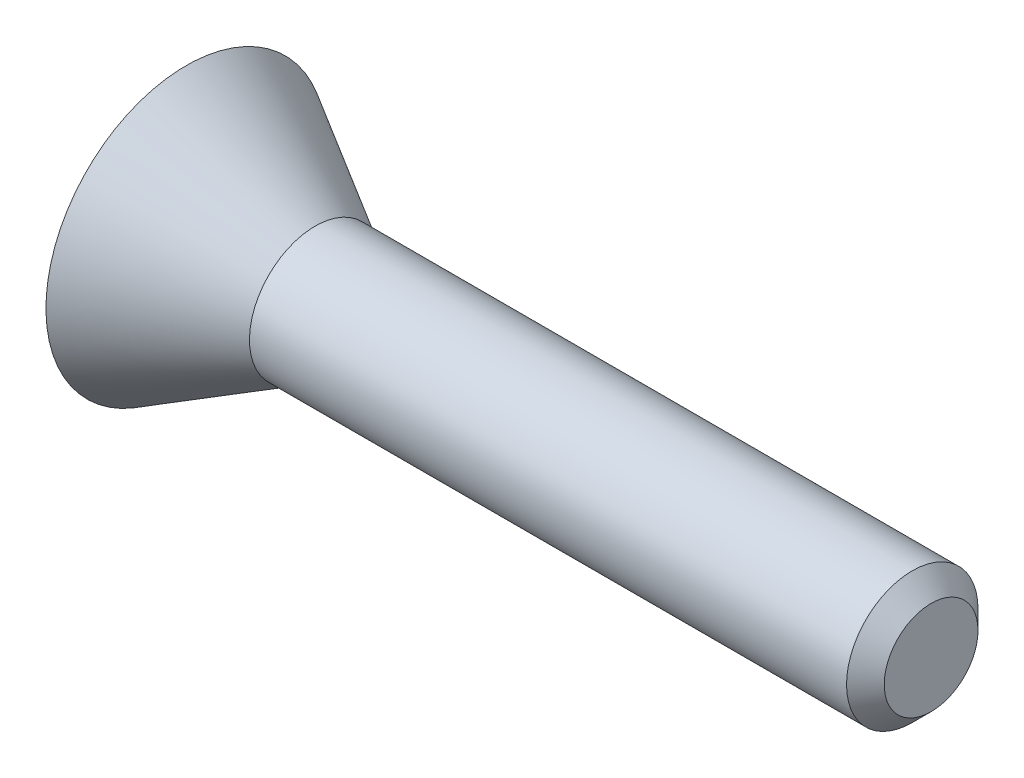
ISO-10303-21;
HEADER;
FILE_DESCRIPTION(('STEP AP214'),'2;1');
FILE_NAME('part.step','',(''),(''),'','','');
FILE_SCHEMA(('AUTOMOTIVE_DESIGN { 1 0 10303 214 1 1 1 1 }'));
ENDSEC;
DATA;
#1=APPLICATION_CONTEXT('core data for automotive mechanical design processes');
#2=APPLICATION_PROTOCOL_DEFINITION('international standard','automotive_design',2000,#1);
#3=PRODUCT_CONTEXT('',#1,'mechanical');
#4=PRODUCT('Part','Part','',(#3));
#5=PRODUCT_RELATED_PRODUCT_CATEGORY('part','',(#4));
#6=PRODUCT_DEFINITION_FORMATION('','',#4);
#7=PRODUCT_DEFINITION_CONTEXT('part definition',#1,'design');
#8=PRODUCT_DEFINITION('design','',#6,#7);
#9=PRODUCT_DEFINITION_SHAPE('','',#8);
#10=(LENGTH_UNIT() NAMED_UNIT(*) SI_UNIT(.MILLI.,.METRE.));
#11=(NAMED_UNIT(*) PLANE_ANGLE_UNIT() SI_UNIT($,.RADIAN.));
#12=(NAMED_UNIT(*) SI_UNIT($,.STERADIAN.) SOLID_ANGLE_UNIT());
#13=UNCERTAINTY_MEASURE_WITH_UNIT(LENGTH_MEASURE(1.E-05),#10,'distance_accuracy_value','');
#14=(GEOMETRIC_REPRESENTATION_CONTEXT(3) GLOBAL_UNCERTAINTY_ASSIGNED_CONTEXT((#13)) GLOBAL_UNIT_ASSIGNED_CONTEXT((#10,
#11,#12)) REPRESENTATION_CONTEXT('',''));
#15=CARTESIAN_POINT('',(0.,0.,0.));
#16=DIRECTION('',(0.,0.,1.));
#17=DIRECTION('',(1.,0.,0.));
#18=AXIS2_PLACEMENT_3D('',#15,#16,#17);
#19=CARTESIAN_POINT('',(-8.5,0.,0.));
#20=DIRECTION('',(1.,0.,0.));
#21=DIRECTION('',(0.,0.,-1.));
#22=AXIS2_PLACEMENT_3D('',#19,#20,#21);
#23=PLANE('',#22);
#24=CARTESIAN_POINT('',(-8.5,-1.27727023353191,-1.27963717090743));
#25=CARTESIAN_POINT('',(-8.5,-1.27675179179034,-1.25379026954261));
#26=CARTESIAN_POINT('',(-8.5,-1.27574322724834,-1.20350830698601));
#27=CARTESIAN_POINT('',(-8.5,-1.26738087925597,-1.13036181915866));
#28=CARTESIAN_POINT('',(-8.5,-1.25285592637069,-1.06179708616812));
#29=CARTESIAN_POINT('',(-8.5,-1.23281056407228,-0.997513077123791));
#30=CARTESIAN_POINT('',(-8.5,-1.20718666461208,-0.937507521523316));
#31=CARTESIAN_POINT('',(-8.5,-1.17577203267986,-0.882046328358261));
#32=CARTESIAN_POINT('',(-8.5,-1.13854452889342,-0.831102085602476));
#33=CARTESIAN_POINT('',(-8.5,-1.09558456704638,-0.784932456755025));
#34=CARTESIAN_POINT('',(-8.5,-1.04742803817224,-0.743862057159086));
#35=CARTESIAN_POINT('',(-8.5,-0.994545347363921,-0.707988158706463));
#36=CARTESIAN_POINT('',(-8.5,-0.936953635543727,-0.677613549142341));
#37=CARTESIAN_POINT('',(-8.5,-0.874623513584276,-0.652978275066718));
#38=CARTESIAN_POINT('',(-8.5,-0.807746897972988,-0.633655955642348));
#39=CARTESIAN_POINT('',(-8.5,-0.736277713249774,-0.620587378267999));
#40=CARTESIAN_POINT('',(-8.5,-0.660172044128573,-0.611785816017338));
#41=CARTESIAN_POINT('',(-8.5,-0.607863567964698,-0.610844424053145));
#42=CARTESIAN_POINT('',(-8.5,-0.580922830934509,-0.610359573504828));
#43=B_SPLINE_CURVE_WITH_KNOTS('',3,(#24,#25,#26,#27,#28,#29,#30,#31,#32,#33,#34,#35,#36,#37,#38,
#39,#40,#41,#42),.UNSPECIFIED.,.F.,.F.,(4,1,1,1,1,1,1,1,1,1,1,1,1,1,1,1,4),(0.,
0.0706034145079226,0.137350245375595,0.20079014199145,0.261822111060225,0.321037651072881,
0.37871381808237,0.435588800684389,0.493032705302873,0.550614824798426,0.60814515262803,
0.667276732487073,0.728130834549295,0.790952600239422,0.857142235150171,0.926423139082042,1.),.UNSPECIFIED.);
#44=CARTESIAN_POINT('',(-8.5,-1.27727023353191,-1.27963717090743));
#45=VERTEX_POINT('',#44);
#46=CARTESIAN_POINT('',(-8.5,-0.580922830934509,-0.610359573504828));
#47=VERTEX_POINT('',#46);
#48=EDGE_CURVE('E381',#45,#47,#43,.T.);
#49=ORIENTED_EDGE('',*,*,#48,.F.);
#50=CARTESIAN_POINT('',(-8.5,-0.568321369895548,-1.95078165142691));
#51=CARTESIAN_POINT('',(-8.5,-0.595570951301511,-1.95027968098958));
#52=CARTESIAN_POINT('',(-8.5,-0.648804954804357,-1.94929904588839));
#53=CARTESIAN_POINT('',(-8.49999999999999,-0.726173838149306,-1.94064904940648));
#54=CARTESIAN_POINT('',(-8.50000000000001,-0.798999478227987,-1.92739541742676));
#55=CARTESIAN_POINT('',(-8.5,-0.867014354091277,-1.90826099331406));
#56=CARTESIAN_POINT('',(-8.5,-0.930387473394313,-1.88350969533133));
#57=CARTESIAN_POINT('',(-8.5,-0.989140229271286,-1.85310310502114));
#58=CARTESIAN_POINT('',(-8.5,-1.04298264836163,-1.81690132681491));
#59=CARTESIAN_POINT('',(-8.5,-1.09230511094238,-1.77593394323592));
#60=CARTESIAN_POINT('',(-8.5,-1.13570677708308,-1.72943872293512));
#61=CARTESIAN_POINT('',(-8.5,-1.17384266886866,-1.67866270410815));
#62=CARTESIAN_POINT('',(-8.5,-1.20642596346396,-1.6234272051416));
#63=CARTESIAN_POINT('',(-8.5,-1.23177323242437,-1.56291446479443));
#64=CARTESIAN_POINT('',(-8.5,-1.25258037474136,-1.49850883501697));
#65=CARTESIAN_POINT('',(-8.5,-1.26671398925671,-1.42932383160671));
#66=CARTESIAN_POINT('',(-8.5,-1.27590269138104,-1.35596144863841));
#67=CARTESIAN_POINT('',(-8.5,-1.27680698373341,-1.30549173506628));
#68=CARTESIAN_POINT('',(-8.5,-1.27727023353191,-1.27963717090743));
#69=B_SPLINE_CURVE_WITH_KNOTS('',3,(#50,#51,#52,#53,#54,#55,#56,#57,#58,#59,#60,#61,#62,#63,#64,
#65,#66,#67,#68),.UNSPECIFIED.,.F.,.F.,(4,1,1,1,1,1,1,1,1,1,1,1,1,1,1,1,4),(0.,
0.0736363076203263,0.143853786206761,0.210167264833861,0.273535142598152,0.334525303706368,
0.393774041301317,0.451974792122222,0.509587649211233,0.566708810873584,0.623480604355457,
0.680964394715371,0.739551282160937,0.800463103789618,0.863640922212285,0.930146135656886,1.),.UNSPECIFIED.);
#70=CARTESIAN_POINT('',(-8.5,-0.568321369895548,-1.95078165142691));
#71=VERTEX_POINT('',#70);
#72=EDGE_CURVE('E54',#71,#45,#69,.T.);
#73=ORIENTED_EDGE('',*,*,#72,.F.);
#74=DIRECTION('',(0.,-1.,0.));
#75=VECTOR('',#74,1.);
#76=CARTESIAN_POINT('',(-8.5,-0.566454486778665,-1.95078165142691));
#77=LINE('',#76,#75);
#78=CARTESIAN_POINT('',(-8.5,-0.566454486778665,-1.95078165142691));
#79=VERTEX_POINT('',#78);
#80=EDGE_CURVE('E425',#79,#71,#77,.T.);
#81=ORIENTED_EDGE('',*,*,#80,.F.);
#82=CARTESIAN_POINT('',(-8.5,0.126625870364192,-1.35384577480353));
#83=CARTESIAN_POINT('',(-8.5,0.126103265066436,-1.37689360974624));
#84=CARTESIAN_POINT('',(-8.5,0.125086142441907,-1.4217505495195));
#85=CARTESIAN_POINT('',(-8.5,0.116764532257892,-1.48702117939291));
#86=CARTESIAN_POINT('',(-8.5,0.102017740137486,-1.54802148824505));
#87=CARTESIAN_POINT('',(-8.5,0.0826594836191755,-1.60551937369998));
#88=CARTESIAN_POINT('',(-8.5,0.0568454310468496,-1.65891117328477));
#89=CARTESIAN_POINT('',(-8.5,0.0252589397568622,-1.70832930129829));
#90=CARTESIAN_POINT('',(-8.5,-0.0117214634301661,-1.75388893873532));
#91=CARTESIAN_POINT('',(-8.5,-0.0545398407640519,-1.79498963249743));
#92=CARTESIAN_POINT('',(-8.5,-0.102104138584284,-1.8320168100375));
#93=CARTESIAN_POINT('',(-8.5,-0.154894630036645,-1.86374759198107));
#94=CARTESIAN_POINT('',(-8.5,-0.212029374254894,-1.89101611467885));
#95=CARTESIAN_POINT('',(-8.5,-0.274079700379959,-1.91274017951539));
#96=CARTESIAN_POINT('',(-8.5,-0.340541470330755,-1.93015104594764));
#97=CARTESIAN_POINT('',(-8.5,-0.411791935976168,-1.94190723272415));
#98=CARTESIAN_POINT('',(-8.5,-0.487561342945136,-1.94968204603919));
#99=CARTESIAN_POINT('',(-8.5,-0.539675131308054,-1.95040840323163));
#100=CARTESIAN_POINT('',(-8.5,-0.566454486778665,-1.95078165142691));
#101=B_SPLINE_CURVE_WITH_KNOTS('',3,(#82,#83,#84,#85,#86,#87,#88,#89,#90,#91,#92,#93,#94,#95,
#96,#97,#98,#99,#100),.UNSPECIFIED.,.F.,.F.,(4,1,1,1,1,1,1,1,1,1,1,1,1,1,1,1,4),(0.,
0.0665766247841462,0.12957501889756,0.189644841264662,0.24763903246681,0.304530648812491,
0.360514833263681,0.416743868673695,0.473642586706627,0.531631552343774,0.590524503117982,
0.65124161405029,0.714220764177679,0.780176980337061,0.849489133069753,0.922658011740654,1.),.UNSPECIFIED.);
#102=CARTESIAN_POINT('',(-8.5,0.126625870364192,-1.35384577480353));
#103=VERTEX_POINT('',#102);
#104=EDGE_CURVE('E417',#103,#79,#101,.T.);
#105=ORIENTED_EDGE('',*,*,#104,.F.);
#106=CARTESIAN_POINT('',(-8.5,-0.0301923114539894,-1.06214528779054));
#107=CARTESIAN_POINT('',(-8.5,-0.0176328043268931,-1.06921572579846));
#108=CARTESIAN_POINT('',(-8.5,0.00698224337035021,-1.08307289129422));
#109=CARTESIAN_POINT('',(-8.5,0.0388398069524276,-1.11036938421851));
#110=CARTESIAN_POINT('',(-8.5,0.0665051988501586,-1.14081294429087));
#111=CARTESIAN_POINT('',(-8.5,0.088509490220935,-1.17602137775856));
#112=CARTESIAN_POINT('',(-8.5,0.105918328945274,-1.21495088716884));
#113=CARTESIAN_POINT('',(-8.5,0.117786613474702,-1.25791987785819));
#114=CARTESIAN_POINT('',(-8.5,0.125572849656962,-1.3045569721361));
#115=CARTESIAN_POINT('',(-8.5,0.126266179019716,-1.33700968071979));
#116=CARTESIAN_POINT('',(-8.5,0.126625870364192,-1.35384577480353));
#117=B_SPLINE_CURVE_WITH_KNOTS('',3,(#106,#107,#108,#109,#110,#111,#112,#113,#114,#115,#116),
.UNSPECIFIED.,.F.,.F.,(4,1,1,1,1,1,1,1,4),(0.,0.123274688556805,0.24160281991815,
0.357777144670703,0.474683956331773,0.595870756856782,0.722082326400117,0.85581948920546,1.),.UNSPECIFIED.);
#118=CARTESIAN_POINT('',(-8.5,0.119628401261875,-1.27088481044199));
#119=VERTEX_POINT('',#118);
#120=EDGE_CURVE('E412',#119,#103,#117,.T.);
#121=ORIENTED_EDGE('',*,*,#120,.F.);
#122=DIRECTION('',(0.,-0.900247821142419,0.435377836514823));
#123=VECTOR('',#122,1.);
#124=CARTESIAN_POINT('',(-8.5,1.05259989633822,-1.72208846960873));
#125=LINE('',#124,#123);
#126=CARTESIAN_POINT('',(-8.5,1.05259989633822,-1.72208846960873));
#127=VERTEX_POINT('',#126);
#128=EDGE_CURVE('E409',#127,#119,#125,.T.);
#129=ORIENTED_EDGE('',*,*,#128,.F.);
#130=DIRECTION('',(0.,0.,-1.));
#131=VECTOR('',#130,1.);
#132=CARTESIAN_POINT('',(-8.5,1.05259989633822,-1.23389853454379));
#133=LINE('',#132,#131);
#134=CARTESIAN_POINT('',(-8.5,1.05259989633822,-1.23389853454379));
#135=VERTEX_POINT('',#134);
#136=EDGE_CURVE('E406',#135,#127,#133,.T.);
#137=ORIENTED_EDGE('',*,*,#136,.F.);
#138=DIRECTION('',(0.,0.905627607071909,-0.424073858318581));
#139=VECTOR('',#138,1.);
#140=CARTESIAN_POINT('',(-8.5,0.0598847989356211,-0.769044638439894));
#141=LINE('',#140,#139);
#142=CARTESIAN_POINT('',(-8.5,0.0598847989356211,-0.769044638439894));
#143=VERTEX_POINT('',#142);
#144=EDGE_CURVE('E400',#143,#135,#141,.T.);
#145=ORIENTED_EDGE('',*,*,#144,.F.);
#146=CARTESIAN_POINT('',(-8.5,-0.579522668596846,-0.610359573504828));
#147=CARTESIAN_POINT('',(-8.5,-0.554299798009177,-0.610948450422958));
#148=CARTESIAN_POINT('',(-8.5,-0.502959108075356,-0.612147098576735));
#149=CARTESIAN_POINT('',(-8.5,-0.425036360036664,-0.620506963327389));
#150=CARTESIAN_POINT('',(-8.5,-0.34502953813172,-0.633424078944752));
#151=CARTESIAN_POINT('',(-8.5,-0.263654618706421,-0.652371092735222));
#152=CARTESIAN_POINT('',(-8.5,-0.18174459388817,-0.675474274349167));
#153=CARTESIAN_POINT('',(-8.5,-0.100242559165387,-0.702842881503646));
#154=CARTESIAN_POINT('',(-8.5,-0.0193404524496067,-0.733275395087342));
#155=CARTESIAN_POINT('',(-8.5,0.0334025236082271,-0.757088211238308));
#156=CARTESIAN_POINT('',(-8.5,0.0598847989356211,-0.769044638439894));
#157=B_SPLINE_CURVE_WITH_KNOTS('',3,(#146,#147,#148,#149,#150,#151,#152,#153,#154,#155,#156),
.UNSPECIFIED.,.F.,.F.,(4,1,1,1,1,1,1,1,4),(0.,0.114002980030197,0.232050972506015,
0.353906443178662,0.480147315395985,0.609491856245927,0.738474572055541,0.868687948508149,1.),.UNSPECIFIED.);
#158=CARTESIAN_POINT('',(-8.5,-0.579522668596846,-0.610359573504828));
#159=VERTEX_POINT('',#158);
#160=EDGE_CURVE('E395',#159,#143,#157,.T.);
#161=ORIENTED_EDGE('',*,*,#160,.F.);
#162=DIRECTION('',(0.,1.,0.));
#163=VECTOR('',#162,1.);
#164=CARTESIAN_POINT('',(-8.5,-0.580922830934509,-0.610359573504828));
#165=LINE('',#164,#163);
#166=EDGE_CURVE('E389',#47,#159,#165,.T.);
#167=ORIENTED_EDGE('',*,*,#166,.F.);
#168=EDGE_LOOP('',(#49,#73,#81,#105,#121,#129,#137,#145,#161,#167));
#169=FACE_BOUND('',#168,.T.);
#170=CARTESIAN_POINT('',(-8.5,0.,0.));
#171=DIRECTION('',(-1.,0.,0.));
#172=DIRECTION('',(0.,-1.,0.));
#173=AXIS2_PLACEMENT_3D('',#170,#171,#172);
#174=CIRCLE('',#173,3.2);
#175=CARTESIAN_POINT('',(-8.5,-3.2,0.));
#176=VERTEX_POINT('',#175);
#177=EDGE_CURVE('E557',#176,#176,#174,.T.);
#178=ORIENTED_EDGE('',*,*,#177,.T.);
#179=EDGE_LOOP('',(#178));
#180=FACE_BOUND('',#179,.T.);
#181=DIRECTION('',(0.,1.,0.));
#182=VECTOR('',#181,1.);
#183=CARTESIAN_POINT('',(-8.5,1.41,0.32));
#184=LINE('',#183,#182);
#185=CARTESIAN_POINT('',(-8.5,-2.11,0.32));
#186=VERTEX_POINT('',#185);
#187=CARTESIAN_POINT('',(-8.5,1.41,0.32));
#188=VERTEX_POINT('',#187);
#189=EDGE_CURVE('E563',#186,#188,#184,.T.);
#190=ORIENTED_EDGE('',*,*,#189,.F.);
#191=CARTESIAN_POINT('',(-8.5,-2.11,0.));
#192=DIRECTION('',(-1.,0.,0.));
#193=DIRECTION('',(0.,0.,1.));
#194=AXIS2_PLACEMENT_3D('',#191,#192,#193);
#195=CIRCLE('',#194,0.32);
#196=CARTESIAN_POINT('',(-8.5,-2.11,-0.32));
#197=VERTEX_POINT('',#196);
#198=EDGE_CURVE('E652',#197,#186,#195,.T.);
#199=ORIENTED_EDGE('',*,*,#198,.F.);
#200=DIRECTION('',(0.,-1.,0.));
#201=VECTOR('',#200,1.);
#202=CARTESIAN_POINT('',(-8.5,1.41,-0.32));
#203=LINE('',#202,#201);
#204=CARTESIAN_POINT('',(-8.5,1.41,-0.32));
#205=VERTEX_POINT('',#204);
#206=EDGE_CURVE('E690',#205,#197,#203,.T.);
#207=ORIENTED_EDGE('',*,*,#206,.F.);
#208=DIRECTION('',(0.,0.,1.));
#209=VECTOR('',#208,1.);
#210=CARTESIAN_POINT('',(-8.5,1.41,-0.77));
#211=LINE('',#210,#209);
#212=CARTESIAN_POINT('',(-8.5,1.41,-0.77));
#213=VERTEX_POINT('',#212);
#214=EDGE_CURVE('E720',#213,#205,#211,.T.);
#215=ORIENTED_EDGE('',*,*,#214,.F.);
#216=DIRECTION('',(0.,-0.856901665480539,-0.515479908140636));
#217=VECTOR('',#216,1.);
#218=CARTESIAN_POINT('',(-8.5,2.69,0.));
#219=LINE('',#218,#217);
#220=CARTESIAN_POINT('',(-8.5,2.69,0.));
#221=VERTEX_POINT('',#220);
#222=EDGE_CURVE('E717',#221,#213,#219,.T.);
#223=ORIENTED_EDGE('',*,*,#222,.F.);
#224=DIRECTION('',(0.,0.856901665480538,-0.515479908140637));
#225=VECTOR('',#224,1.);
#226=CARTESIAN_POINT('',(-8.5,2.69,0.));
#227=LINE('',#226,#225);
#228=CARTESIAN_POINT('',(-8.5,1.41,0.77));
#229=VERTEX_POINT('',#228);
#230=EDGE_CURVE('E714',#229,#221,#227,.T.);
#231=ORIENTED_EDGE('',*,*,#230,.F.);
#232=DIRECTION('',(0.,0.,1.));
#233=VECTOR('',#232,1.);
#234=CARTESIAN_POINT('',(-8.5,1.41,0.77));
#235=LINE('',#234,#233);
#236=EDGE_CURVE('E711',#188,#229,#235,.T.);
#237=ORIENTED_EDGE('',*,*,#236,.F.);
#238=EDGE_LOOP('',(#190,#199,#207,#215,#223,#231,#237));
#239=FACE_BOUND('',#238,.T.);
#240=DIRECTION('',(0.,1.,0.));
#241=VECTOR('',#240,1.);
#242=CARTESIAN_POINT('',(-8.5,-1.24740010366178,1.96229870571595));
#243=LINE('',#242,#241);
#244=CARTESIAN_POINT('',(-8.5,-1.24740010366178,1.96229870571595));
#245=VERTEX_POINT('',#244);
#246=CARTESIAN_POINT('',(-8.5,-0.856288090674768,1.96229870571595));
#247=VERTEX_POINT('',#246);
#248=EDGE_CURVE('E568',#245,#247,#243,.T.);
#249=ORIENTED_EDGE('',*,*,#248,.F.);
#250=DIRECTION('',(0.,0.,1.));
#251=VECTOR('',#250,1.);
#252=CARTESIAN_POINT('',(-8.5,-1.24740010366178,0.607875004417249));
#253=LINE('',#252,#251);
#254=CARTESIAN_POINT('',(-8.5,-1.24740010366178,0.607875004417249));
#255=VERTEX_POINT('',#254);
#256=EDGE_CURVE('E434',#255,#245,#253,.T.);
#257=ORIENTED_EDGE('',*,*,#256,.F.);
#258=DIRECTION('',(0.,-1.,0.));
#259=VECTOR('',#258,1.);
#260=CARTESIAN_POINT('',(-8.5,-0.829218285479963,0.607875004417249));
#261=LINE('',#260,#259);
#262=CARTESIAN_POINT('',(-8.5,-0.829218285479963,0.607875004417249));
#263=VERTEX_POINT('',#262);
#264=EDGE_CURVE('E456',#263,#255,#261,.T.);
#265=ORIENTED_EDGE('',*,*,#264,.F.);
#266=DIRECTION('',(0.,0.,-1.));
#267=VECTOR('',#266,1.);
#268=CARTESIAN_POINT('',(-8.5,-0.829218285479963,1.3905657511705));
#269=LINE('',#268,#267);
#270=CARTESIAN_POINT('',(-8.5,-0.829218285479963,1.3905657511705));
#271=VERTEX_POINT('',#270);
#272=EDGE_CURVE('E645',#271,#263,#269,.T.);
#273=ORIENTED_EDGE('',*,*,#272,.F.);
#274=DIRECTION('',(0.,-0.786034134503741,0.618183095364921));
#275=VECTOR('',#274,1.);
#276=CARTESIAN_POINT('',(-8.5,-0.112335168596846,0.826767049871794));
#277=LINE('',#276,#275);
#278=CARTESIAN_POINT('',(-8.5,-0.112335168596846,0.826767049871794));
#279=VERTEX_POINT('',#278);
#280=EDGE_CURVE('E639',#279,#271,#277,.T.);
#281=ORIENTED_EDGE('',*,*,#280,.F.);
#282=CARTESIAN_POINT('',(-8.5,0.479466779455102,0.62047646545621));
#283=CARTESIAN_POINT('',(-8.5,0.453297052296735,0.621071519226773));
#284=CARTESIAN_POINT('',(-8.5,0.400911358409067,0.622262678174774));
#285=CARTESIAN_POINT('',(-8.5,0.322508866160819,0.633014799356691));
#286=CARTESIAN_POINT('',(-8.5,0.244506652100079,0.650341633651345));
#287=CARTESIAN_POINT('',(-8.5,0.167281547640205,0.674137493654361));
#288=CARTESIAN_POINT('',(-8.5,0.0921712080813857,0.703698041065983));
#289=CARTESIAN_POINT('',(-8.5,0.020204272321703,0.739176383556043));
#290=CARTESIAN_POINT('',(-8.5,-0.0486511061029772,0.779218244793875));
#291=CARTESIAN_POINT('',(-8.5,-0.0911477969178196,0.810947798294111));
#292=CARTESIAN_POINT('',(-8.5,-0.112335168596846,0.826767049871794));
#293=B_SPLINE_CURVE_WITH_KNOTS('',3,(#282,#283,#284,#285,#286,#287,#288,#289,#290,#291,#292),
.UNSPECIFIED.,.F.,.F.,(4,1,1,1,1,1,1,1,4),(0.,0.123046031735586,0.246309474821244,
0.371480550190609,0.498560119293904,0.626024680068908,0.750715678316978,0.875715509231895,1.),.UNSPECIFIED.);
#294=CARTESIAN_POINT('',(-8.5,0.479466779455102,0.62047646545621));
#295=VERTEX_POINT('',#294);
#296=EDGE_CURVE('E634',#295,#279,#293,.T.);
#297=ORIENTED_EDGE('',*,*,#296,.F.);
#298=DIRECTION('',(0.,-1.,0.));
#299=VECTOR('',#298,1.);
#300=CARTESIAN_POINT('',(-8.5,0.481333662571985,0.62047646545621));
#301=LINE('',#300,#299);
#302=CARTESIAN_POINT('',(-8.5,0.481333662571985,0.62047646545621));
#303=VERTEX_POINT('',#302);
#304=EDGE_CURVE('E628',#303,#295,#301,.T.);
#305=ORIENTED_EDGE('',*,*,#304,.F.);
#306=CARTESIAN_POINT('',(-8.5,1.08247002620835,1.29768831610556));
#307=CARTESIAN_POINT('',(-8.5,1.08209845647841,1.2715308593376));
#308=CARTESIAN_POINT('',(-8.5,1.08137580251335,1.22065806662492));
#309=CARTESIAN_POINT('',(-8.5,1.07357497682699,1.14659608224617));
#310=CARTESIAN_POINT('',(-8.5,1.06180125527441,1.07691160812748));
#311=CARTESIAN_POINT('',(-8.5,1.04457686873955,1.01171677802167));
#312=CARTESIAN_POINT('',(-8.5,1.02210917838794,0.951273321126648));
#313=CARTESIAN_POINT('',(-8.5,0.995018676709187,0.89540016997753));
#314=CARTESIAN_POINT('',(-8.5,0.963074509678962,0.843980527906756));
#315=CARTESIAN_POINT('',(-8.5,0.926208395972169,0.797408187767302));
#316=CARTESIAN_POINT('',(-8.5,0.885090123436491,0.755504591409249));
#317=CARTESIAN_POINT('',(-8.5,0.839302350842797,0.719436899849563));
#318=CARTESIAN_POINT('',(-8.5,0.789770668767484,0.688214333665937));
#319=CARTESIAN_POINT('',(-8.5,0.735534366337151,0.663807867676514));
#320=CARTESIAN_POINT('',(-8.5,0.677868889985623,0.643714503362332));
#321=CARTESIAN_POINT('',(-8.5,0.615740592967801,0.630704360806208));
#322=CARTESIAN_POINT('',(-8.5,0.549880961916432,0.62193718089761));
#323=CARTESIAN_POINT('',(-8.5,0.504544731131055,0.620971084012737));
#324=CARTESIAN_POINT('',(-8.5,0.481333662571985,0.62047646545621));
#325=B_SPLINE_CURVE_WITH_KNOTS('',3,(#306,#307,#308,#309,#310,#311,#312,#313,#314,#315,#316,
#317,#318,#319,#320,#321,#322,#323,#324),.UNSPECIFIED.,.F.,.F.,(4,1,1,1,1,1,1,1,1,1,1,1,1,1,1,1,
4),(0.,0.0762312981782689,0.148259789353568,0.216860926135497,0.28210063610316,
0.344528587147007,0.404571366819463,0.462840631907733,0.520642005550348,0.577409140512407,
0.633580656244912,0.690215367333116,0.747647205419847,0.806597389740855,0.867894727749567,
0.932365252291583,1.),.UNSPECIFIED.);
#326=CARTESIAN_POINT('',(-8.5,1.08247002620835,1.29768831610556));
#327=VERTEX_POINT('',#326);
#328=EDGE_CURVE('E620',#327,#303,#325,.T.);
#329=ORIENTED_EDGE('',*,*,#328,.F.);
#330=CARTESIAN_POINT('',(-8.5,0.392189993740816,1.99076867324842));
#331=CARTESIAN_POINT('',(-8.5,0.418850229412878,1.9885854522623));
#332=CARTESIAN_POINT('',(-8.5,0.470890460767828,1.98432384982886));
#333=CARTESIAN_POINT('',(-8.5,0.546169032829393,1.97035246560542));
#334=CARTESIAN_POINT('',(-8.5,0.617076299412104,1.95229500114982));
#335=CARTESIAN_POINT('',(-8.5,0.683598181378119,1.92932347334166));
#336=CARTESIAN_POINT('',(-8.5,0.744964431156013,1.89980497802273));
#337=CARTESIAN_POINT('',(-8.5,0.802457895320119,1.86664005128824));
#338=CARTESIAN_POINT('',(-8.5,0.854300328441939,1.82675095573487));
#339=CARTESIAN_POINT('',(-8.5,0.902226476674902,1.78308675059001));
#340=CARTESIAN_POINT('',(-8.5,0.944439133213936,1.73445263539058));
#341=CARTESIAN_POINT('',(-8.5,0.981676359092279,1.68259530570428));
#342=CARTESIAN_POINT('',(-8.5,1.01266376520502,1.62673059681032));
#343=CARTESIAN_POINT('',(-8.5,1.03836964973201,1.56770780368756));
#344=CARTESIAN_POINT('',(-8.5,1.05787968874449,1.50487253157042));
#345=CARTESIAN_POINT('',(-8.5,1.07249419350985,1.43904555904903));
#346=CARTESIAN_POINT('',(-8.5,1.08092241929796,1.36947131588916));
#347=CARTESIAN_POINT('',(-8.5,1.08194630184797,1.32198034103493));
#348=CARTESIAN_POINT('',(-8.5,1.08247002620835,1.29768831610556));
#349=B_SPLINE_CURVE_WITH_KNOTS('',3,(#330,#331,#332,#333,#334,#335,#336,#337,#338,#339,#340,
#341,#342,#343,#344,#345,#346,#347,#348),.UNSPECIFIED.,.F.,.F.,(4,1,1,1,1,1,1,1,1,1,1,1,1,1,1,1,
4),(0.,0.0733268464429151,0.14313249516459,0.209679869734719,0.273918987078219,
0.335762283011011,0.396210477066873,0.45560885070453,0.514796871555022,0.573764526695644,
0.631900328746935,0.689592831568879,0.748648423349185,0.808163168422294,0.86976604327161,
0.933384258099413,1.),.UNSPECIFIED.);
#350=CARTESIAN_POINT('',(-8.5,0.392189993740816,1.99076867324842));
#351=VERTEX_POINT('',#350);
#352=EDGE_CURVE('E615',#351,#327,#349,.T.);
#353=ORIENTED_EDGE('',*,*,#352,.F.);
#354=DIRECTION('',(0.,1.,0.));
#355=VECTOR('',#354,1.);
#356=CARTESIAN_POINT('',(-8.5,0.390789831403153,1.99076867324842));
#357=LINE('',#356,#355);
#358=CARTESIAN_POINT('',(-8.5,0.390789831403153,1.99076867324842));
#359=VERTEX_POINT('',#358);
#360=EDGE_CURVE('E612',#359,#351,#357,.T.);
#361=ORIENTED_EDGE('',*,*,#360,.F.);
#362=DIRECTION('',(0.,0.,1.));
#363=VECTOR('',#362,1.);
#364=CARTESIAN_POINT('',(-8.5,0.390789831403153,1.54831737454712));
#365=LINE('',#364,#363);
#366=CARTESIAN_POINT('',(-8.5,0.390789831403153,1.54831737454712));
#367=VERTEX_POINT('',#366);
#368=EDGE_CURVE('E609',#367,#359,#365,.T.);
#369=ORIENTED_EDGE('',*,*,#368,.F.);
#370=DIRECTION('',(0.,-1.,0.));
#371=VECTOR('',#370,1.);
#372=CARTESIAN_POINT('',(-8.5,0.392189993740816,1.54831737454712));
#373=LINE('',#372,#371);
#374=CARTESIAN_POINT('',(-8.5,0.392189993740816,1.54831737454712));
#375=VERTEX_POINT('',#374);
#376=EDGE_CURVE('E603',#375,#367,#373,.T.);
#377=ORIENTED_EDGE('',*,*,#376,.F.);
#378=CARTESIAN_POINT('',(-8.5,0.66428820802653,1.29442127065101));
#379=CARTESIAN_POINT('',(-8.5,0.663628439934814,1.31132964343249));
#380=CARTESIAN_POINT('',(-8.5,0.662346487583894,1.34418319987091));
#381=CARTESIAN_POINT('',(-8.5,0.648138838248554,1.39069300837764));
#382=CARTESIAN_POINT('',(-8.5,0.625853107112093,1.43260288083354));
#383=CARTESIAN_POINT('',(-8.5,0.594054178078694,1.46873251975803));
#384=CARTESIAN_POINT('',(-8.5,0.554129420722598,1.49865059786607));
#385=CARTESIAN_POINT('',(-8.5,0.507114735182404,1.52293201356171));
#386=CARTESIAN_POINT('',(-8.5,0.45216129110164,1.53942376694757));
#387=CARTESIAN_POINT('',(-8.5,0.412823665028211,1.5452574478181));
#388=CARTESIAN_POINT('',(-8.5,0.392189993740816,1.54831737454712));
#389=B_SPLINE_CURVE_WITH_KNOTS('',3,(#378,#379,#380,#381,#382,#383,#384,#385,#386,#387,#388),
.UNSPECIFIED.,.F.,.F.,(4,1,1,1,1,1,1,1,4),(0.,0.122603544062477,0.238222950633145,
0.350089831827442,0.465559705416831,0.58502806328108,0.711014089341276,0.848418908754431,1.),.UNSPECIFIED.);
#390=CARTESIAN_POINT('',(-8.5,0.66428820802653,1.29442127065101));
#391=VERTEX_POINT('',#390);
#392=EDGE_CURVE('E595',#391,#375,#389,.T.);
#393=ORIENTED_EDGE('',*,*,#392,.F.);
#394=CARTESIAN_POINT('',(-8.5,0.469198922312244,1.06479464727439));
#395=CARTESIAN_POINT('',(-8.5,0.483904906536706,1.065432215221));
#396=CARTESIAN_POINT('',(-8.5,0.512079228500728,1.06665369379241));
#397=CARTESIAN_POINT('',(-8.5,0.551777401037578,1.07816193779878));
#398=CARTESIAN_POINT('',(-8.5,0.586348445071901,1.09702333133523));
#399=CARTESIAN_POINT('',(-8.5,0.614904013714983,1.12403740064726));
#400=CARTESIAN_POINT('',(-8.5,0.637489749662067,1.15766784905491));
#401=CARTESIAN_POINT('',(-8.5,0.653406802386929,1.19790761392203));
#402=CARTESIAN_POINT('',(-8.5,0.662534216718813,1.24423019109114));
#403=CARTESIAN_POINT('',(-8.5,0.663683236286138,1.27710979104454));
#404=CARTESIAN_POINT('',(-8.5,0.66428820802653,1.29442127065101));
#405=B_SPLINE_CURVE_WITH_KNOTS('',3,(#394,#395,#396,#397,#398,#399,#400,#401,#402,#403,#404),
.UNSPECIFIED.,.F.,.F.,(4,1,1,1,1,1,1,1,4),(0.,0.128749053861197,0.246662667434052,
0.359069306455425,0.47107757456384,0.588039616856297,0.711712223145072,0.848213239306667,1.),.UNSPECIFIED.);
#406=CARTESIAN_POINT('',(-8.5,0.469198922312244,1.06479464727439));
#407=VERTEX_POINT('',#406);
#408=EDGE_CURVE('E590',#407,#391,#405,.T.);
#409=ORIENTED_EDGE('',*,*,#408,.F.);
#410=DIRECTION('',(0.,1.,0.));
#411=VECTOR('',#410,1.);
#412=CARTESIAN_POINT('',(-8.5,0.465931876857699,1.06479464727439));
#413=LINE('',#412,#411);
#414=CARTESIAN_POINT('',(-8.5,0.465931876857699,1.06479464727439));
#415=VERTEX_POINT('',#414);
#416=EDGE_CURVE('E584',#415,#407,#413,.T.);
#417=ORIENTED_EDGE('',*,*,#416,.F.);
#418=CARTESIAN_POINT('',(-8.5,0.18496596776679,1.17634091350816));
#419=CARTESIAN_POINT('',(-8.5,0.208161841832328,1.15987888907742));
#420=CARTESIAN_POINT('',(-8.5,0.253358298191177,1.12780313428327));
#421=CARTESIAN_POINT('',(-8.5,0.315426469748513,1.09877210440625));
#422=CARTESIAN_POINT('',(-8.5,0.364088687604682,1.08068697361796));
#423=CARTESIAN_POINT('',(-8.5,0.399378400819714,1.07206799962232));
#424=CARTESIAN_POINT('',(-8.5,0.433048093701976,1.06591949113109));
#425=CARTESIAN_POINT('',(-8.5,0.455171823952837,1.06516271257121));
#426=CARTESIAN_POINT('',(-8.5,0.465931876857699,1.06479464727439));
#427=B_SPLINE_CURVE_WITH_KNOTS('',3,(#418,#419,#420,#421,#422,#423,#424,#425,#426),
.UNSPECIFIED.,.F.,.F.,(4,1,1,1,1,1,4),(0.,0.27737542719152,0.540457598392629,0.666416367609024,
0.784009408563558,0.894951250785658,1.),.UNSPECIFIED.);
#428=CARTESIAN_POINT('',(-8.5,0.18496596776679,1.17634091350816));
#429=VERTEX_POINT('',#428);
#430=EDGE_CURVE('E575',#429,#415,#427,.T.);
#431=ORIENTED_EDGE('',*,*,#430,.F.);
#432=DIRECTION('',(0.,0.798150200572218,-0.602458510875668));
#433=VECTOR('',#432,1.);
#434=CARTESIAN_POINT('',(-8.5,-0.856288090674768,1.96229870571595));
#435=LINE('',#434,#433);
#436=EDGE_CURVE('E572',#247,#429,#435,.T.);
#437=ORIENTED_EDGE('',*,*,#436,.F.);
#438=EDGE_LOOP('',(#249,#257,#265,#273,#281,#297,#305,#329,#353,#361,#369,#377,#393,#409,#417,
#431,#437));
#439=FACE_BOUND('',#438,.T.);
#440=ADVANCED_FACE('F39',(#169,#180,#239,#439),#23,.F.);
#441=CARTESIAN_POINT('',(-8.5,0.,0.));
#442=DIRECTION('',(-1.,0.,0.));
#443=DIRECTION('',(0.,-1.,0.));
#444=AXIS2_PLACEMENT_3D('',#441,#442,#443);
#445=CONICAL_SURFACE('',#444,3.2,0.523598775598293);
#446=CARTESIAN_POINT('',(-5.55551362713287,0.,0.));
#447=DIRECTION('',(-1.,0.,0.));
#448=DIRECTION('',(0.,-1.,0.));
#449=AXIS2_PLACEMENT_3D('',#446,#447,#448);
#450=CIRCLE('',#449,1.5);
#451=CARTESIAN_POINT('',(-5.55551362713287,-1.5,0.));
#452=VERTEX_POINT('',#451);
#453=EDGE_CURVE('E727',#452,#452,#450,.T.);
#454=ORIENTED_EDGE('',*,*,#453,.T.);
#455=EDGE_LOOP('',(#454));
#456=FACE_BOUND('',#455,.T.);
#457=ORIENTED_EDGE('',*,*,#177,.F.);
#458=EDGE_LOOP('',(#457));
#459=FACE_BOUND('',#458,.T.);
#460=ADVANCED_FACE('F530',(#456,#459),#445,.T.);
#461=CARTESIAN_POINT('',(-8.5,0.,0.));
#462=DIRECTION('',(-1.,0.,0.));
#463=DIRECTION('',(0.,-1.,0.));
#464=AXIS2_PLACEMENT_3D('',#461,#462,#463);
#465=CYLINDRICAL_SURFACE('',#464,1.5);
#466=CARTESIAN_POINT('',(8.07,0.,0.));
#467=DIRECTION('',(1.,0.,0.));
#468=DIRECTION('',(0.,1.,0.));
#469=AXIS2_PLACEMENT_3D('',#466,#467,#468);
#470=CIRCLE('',#469,1.5);
#471=CARTESIAN_POINT('',(8.07,1.5,0.));
#472=VERTEX_POINT('',#471);
#473=EDGE_CURVE('E47',#472,#472,#470,.F.);
#474=ORIENTED_EDGE('',*,*,#473,.T.);
#475=EDGE_LOOP('',(#474));
#476=FACE_BOUND('',#475,.T.);
#477=ORIENTED_EDGE('',*,*,#453,.F.);
#478=EDGE_LOOP('',(#477));
#479=FACE_BOUND('',#478,.T.);
#480=ADVANCED_FACE('F527',(#476,#479),#465,.T.);
#481=CARTESIAN_POINT('',(8.5,0.,0.));
#482=DIRECTION('',(1.,0.,0.));
#483=DIRECTION('',(0.,0.,-1.));
#484=AXIS2_PLACEMENT_3D('',#481,#482,#483);
#485=PLANE('',#484);
#486=CARTESIAN_POINT('',(8.5,0.,0.));
#487=DIRECTION('',(1.,0.,0.));
#488=DIRECTION('',(0.,0.,-1.));
#489=AXIS2_PLACEMENT_3D('',#486,#487,#488);
#490=CIRCLE('',#489,1.07);
#491=CARTESIAN_POINT('',(8.5,0.,-1.07));
#492=VERTEX_POINT('',#491);
#493=EDGE_CURVE('E11',#492,#492,#490,.T.);
#494=ORIENTED_EDGE('',*,*,#493,.T.);
#495=EDGE_LOOP('',(#494));
#496=FACE_BOUND('',#495,.T.);
#497=ADVANCED_FACE('F525',(#496),#485,.T.);
#498=CARTESIAN_POINT('',(-7.9,-2.11,0.));
#499=DIRECTION('',(-1.,0.,0.));
#500=DIRECTION('',(0.,0.,1.));
#501=AXIS2_PLACEMENT_3D('',#498,#499,#500);
#502=CYLINDRICAL_SURFACE('',#501,0.32);
#503=ORIENTED_EDGE('',*,*,#198,.T.);
#504=DIRECTION('',(-1.,0.,0.));
#505=VECTOR('',#504,1.);
#506=CARTESIAN_POINT('',(-7.9,-2.11,0.32));
#507=LINE('',#506,#505);
#508=CARTESIAN_POINT('',(-7.9,-2.11,0.32));
#509=VERTEX_POINT('',#508);
#510=EDGE_CURVE('E708',#509,#186,#507,.T.);
#511=ORIENTED_EDGE('',*,*,#510,.F.);
#512=CARTESIAN_POINT('',(-7.9,-2.11,0.));
#513=DIRECTION('',(-1.,0.,0.));
#514=DIRECTION('',(0.,0.,1.));
#515=AXIS2_PLACEMENT_3D('',#512,#513,#514);
#516=CIRCLE('',#515,0.32);
#517=CARTESIAN_POINT('',(-7.9,-2.11,-0.32));
#518=VERTEX_POINT('',#517);
#519=EDGE_CURVE('E686',#518,#509,#516,.T.);
#520=ORIENTED_EDGE('',*,*,#519,.F.);
#521=DIRECTION('',(-1.,0.,0.));
#522=VECTOR('',#521,1.);
#523=CARTESIAN_POINT('',(-7.9,-2.11,-0.32));
#524=LINE('',#523,#522);
#525=EDGE_CURVE('E725',#518,#197,#524,.T.);
#526=ORIENTED_EDGE('',*,*,#525,.T.);
#527=EDGE_LOOP('',(#503,#511,#520,#526));
#528=FACE_BOUND('',#527,.T.);
#529=ADVANCED_FACE('F503',(#528),#502,.F.);
#530=CARTESIAN_POINT('',(-7.9,1.41,-0.32));
#531=DIRECTION('',(0.,0.,-1.));
#532=DIRECTION('',(0.,1.,0.));
#533=AXIS2_PLACEMENT_3D('',#530,#531,#532);
#534=PLANE('',#533);
#535=ORIENTED_EDGE('',*,*,#206,.T.);
#536=ORIENTED_EDGE('',*,*,#525,.F.);
#537=DIRECTION('',(0.,-1.,0.));
#538=VECTOR('',#537,1.);
#539=CARTESIAN_POINT('',(-7.9,1.41,-0.32));
#540=LINE('',#539,#538);
#541=CARTESIAN_POINT('',(-7.9,1.41,-0.32));
#542=VERTEX_POINT('',#541);
#543=EDGE_CURVE('E705',#542,#518,#540,.T.);
#544=ORIENTED_EDGE('',*,*,#543,.F.);
#545=DIRECTION('',(-1.,0.,0.));
#546=VECTOR('',#545,1.);
#547=CARTESIAN_POINT('',(-7.9,1.41,-0.32));
#548=LINE('',#547,#546);
#549=EDGE_CURVE('E728',#542,#205,#548,.T.);
#550=ORIENTED_EDGE('',*,*,#549,.T.);
#551=EDGE_LOOP('',(#535,#536,#544,#550));
#552=FACE_BOUND('',#551,.T.);
#553=ADVANCED_FACE('F499',(#552),#534,.F.);
#554=CARTESIAN_POINT('',(-7.9,1.41,-0.77));
#555=DIRECTION('',(0.,-1.,0.));
#556=DIRECTION('',(0.,0.,-1.));
#557=AXIS2_PLACEMENT_3D('',#554,#555,#556);
#558=PLANE('',#557);
#559=ORIENTED_EDGE('',*,*,#214,.T.);
#560=ORIENTED_EDGE('',*,*,#549,.F.);
#561=DIRECTION('',(0.,0.,1.));
#562=VECTOR('',#561,1.);
#563=CARTESIAN_POINT('',(-7.9,1.41,-0.77));
#564=LINE('',#563,#562);
#565=CARTESIAN_POINT('',(-7.9,1.41,-0.77));
#566=VERTEX_POINT('',#565);
#567=EDGE_CURVE('E702',#566,#542,#564,.T.);
#568=ORIENTED_EDGE('',*,*,#567,.F.);
#569=DIRECTION('',(-1.,0.,0.));
#570=VECTOR('',#569,1.);
#571=CARTESIAN_POINT('',(-7.9,1.41,-0.77));
#572=LINE('',#571,#570);
#573=EDGE_CURVE('E730',#566,#213,#572,.T.);
#574=ORIENTED_EDGE('',*,*,#573,.T.);
#575=EDGE_LOOP('',(#559,#560,#568,#574));
#576=FACE_BOUND('',#575,.T.);
#577=ADVANCED_FACE('F502',(#576),#558,.F.);
#578=CARTESIAN_POINT('',(-7.9,2.69,0.));
#579=DIRECTION('',(0.,0.515479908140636,-0.856901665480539));
#580=DIRECTION('',(0.,0.856901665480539,0.515479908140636));
#581=AXIS2_PLACEMENT_3D('',#578,#579,#580);
#582=PLANE('',#581);
#583=ORIENTED_EDGE('',*,*,#222,.T.);
#584=ORIENTED_EDGE('',*,*,#573,.F.);
#585=DIRECTION('',(0.,-0.856901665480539,-0.515479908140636));
#586=VECTOR('',#585,1.);
#587=CARTESIAN_POINT('',(-7.9,2.69,0.));
#588=LINE('',#587,#586);
#589=CARTESIAN_POINT('',(-7.9,2.69,0.));
#590=VERTEX_POINT('',#589);
#591=EDGE_CURVE('E699',#590,#566,#588,.T.);
#592=ORIENTED_EDGE('',*,*,#591,.F.);
#593=DIRECTION('',(-1.,0.,0.));
#594=VECTOR('',#593,1.);
#595=CARTESIAN_POINT('',(-7.9,2.69,0.));
#596=LINE('',#595,#594);
#597=EDGE_CURVE('E732',#590,#221,#596,.T.);
#598=ORIENTED_EDGE('',*,*,#597,.T.);
#599=EDGE_LOOP('',(#583,#584,#592,#598));
#600=FACE_BOUND('',#599,.T.);
#601=ADVANCED_FACE('F507',(#600),#582,.F.);
#602=CARTESIAN_POINT('',(-7.9,2.69,0.));
#603=DIRECTION('',(0.,0.515479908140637,0.856901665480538));
#604=DIRECTION('',(0.,-0.856901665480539,0.515479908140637));
#605=AXIS2_PLACEMENT_3D('',#602,#603,#604);
#606=PLANE('',#605);
#607=ORIENTED_EDGE('',*,*,#230,.T.);
#608=ORIENTED_EDGE('',*,*,#597,.F.);
#609=DIRECTION('',(0.,0.856901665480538,-0.515479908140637));
#610=VECTOR('',#609,1.);
#611=CARTESIAN_POINT('',(-7.9,2.69,0.));
#612=LINE('',#611,#610);
#613=CARTESIAN_POINT('',(-7.9,1.41,0.77));
#614=VERTEX_POINT('',#613);
#615=EDGE_CURVE('E696',#614,#590,#612,.T.);
#616=ORIENTED_EDGE('',*,*,#615,.F.);
#617=DIRECTION('',(-1.,0.,0.));
#618=VECTOR('',#617,1.);
#619=CARTESIAN_POINT('',(-7.9,1.41,0.77));
#620=LINE('',#619,#618);
#621=EDGE_CURVE('E734',#614,#229,#620,.T.);
#622=ORIENTED_EDGE('',*,*,#621,.T.);
#623=EDGE_LOOP('',(#607,#608,#616,#622));
#624=FACE_BOUND('',#623,.T.);
#625=ADVANCED_FACE('F511',(#624),#606,.F.);
#626=CARTESIAN_POINT('',(-7.9,1.41,0.77));
#627=DIRECTION('',(0.,-1.,0.));
#628=DIRECTION('',(0.,0.,-1.));
#629=AXIS2_PLACEMENT_3D('',#626,#627,#628);
#630=PLANE('',#629);
#631=ORIENTED_EDGE('',*,*,#236,.T.);
#632=ORIENTED_EDGE('',*,*,#621,.F.);
#633=DIRECTION('',(0.,0.,1.));
#634=VECTOR('',#633,1.);
#635=CARTESIAN_POINT('',(-7.9,1.41,0.77));
#636=LINE('',#635,#634);
#637=CARTESIAN_POINT('',(-7.9,1.41,0.32));
#638=VERTEX_POINT('',#637);
#639=EDGE_CURVE('E693',#638,#614,#636,.T.);
#640=ORIENTED_EDGE('',*,*,#639,.F.);
#641=DIRECTION('',(-1.,0.,0.));
#642=VECTOR('',#641,1.);
#643=CARTESIAN_POINT('',(-7.9,1.41,0.32));
#644=LINE('',#643,#642);
#645=EDGE_CURVE('E736',#638,#188,#644,.T.);
#646=ORIENTED_EDGE('',*,*,#645,.T.);
#647=EDGE_LOOP('',(#631,#632,#640,#646));
#648=FACE_BOUND('',#647,.T.);
#649=ADVANCED_FACE('F515',(#648),#630,.F.);
#650=CARTESIAN_POINT('',(-7.9,1.41,0.32));
#651=DIRECTION('',(0.,0.,1.));
#652=DIRECTION('',(0.,-1.,0.));
#653=AXIS2_PLACEMENT_3D('',#650,#651,#652);
#654=PLANE('',#653);
#655=ORIENTED_EDGE('',*,*,#189,.T.);
#656=ORIENTED_EDGE('',*,*,#645,.F.);
#657=DIRECTION('',(0.,1.,0.));
#658=VECTOR('',#657,1.);
#659=CARTESIAN_POINT('',(-7.9,1.41,0.32));
#660=LINE('',#659,#658);
#661=EDGE_CURVE('E689',#509,#638,#660,.T.);
#662=ORIENTED_EDGE('',*,*,#661,.F.);
#663=ORIENTED_EDGE('',*,*,#510,.T.);
#664=EDGE_LOOP('',(#655,#656,#662,#663));
#665=FACE_BOUND('',#664,.T.);
#666=ADVANCED_FACE('F497',(#665),#654,.F.);
#667=CARTESIAN_POINT('',(-7.9,-2.11,0.));
#668=DIRECTION('',(-1.,0.,0.));
#669=DIRECTION('',(0.,0.,1.));
#670=AXIS2_PLACEMENT_3D('',#667,#668,#669);
#671=PLANE('',#670);
#672=ORIENTED_EDGE('',*,*,#519,.T.);
#673=ORIENTED_EDGE('',*,*,#661,.T.);
#674=ORIENTED_EDGE('',*,*,#639,.T.);
#675=ORIENTED_EDGE('',*,*,#615,.T.);
#676=ORIENTED_EDGE('',*,*,#591,.T.);
#677=ORIENTED_EDGE('',*,*,#567,.T.);
#678=ORIENTED_EDGE('',*,*,#543,.T.);
#679=EDGE_LOOP('',(#672,#673,#674,#675,#676,#677,#678));
#680=FACE_BOUND('',#679,.T.);
#681=ADVANCED_FACE('F494',(#680),#671,.T.);
#682=CARTESIAN_POINT('',(8.07,0.,0.));
#683=DIRECTION('',(-1.,0.,0.));
#684=DIRECTION('',(0.,-1.,0.));
#685=AXIS2_PLACEMENT_3D('',#682,#683,#684);
#686=CONICAL_SURFACE('',#685,1.5,0.785398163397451);
#687=ORIENTED_EDGE('',*,*,#493,.F.);
#688=EDGE_LOOP('',(#687));
#689=FACE_BOUND('',#688,.T.);
#690=ORIENTED_EDGE('',*,*,#473,.F.);
#691=EDGE_LOOP('',(#690));
#692=FACE_BOUND('',#691,.T.);
#693=ADVANCED_FACE('F41',(#689,#692),#686,.T.);
#694=CARTESIAN_POINT('',(-7.9,-1.24740010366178,0.607875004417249));
#695=DIRECTION('',(0.,-1.,0.));
#696=DIRECTION('',(0.,0.,-1.));
#697=AXIS2_PLACEMENT_3D('',#694,#695,#696);
#698=PLANE('',#697);
#699=ORIENTED_EDGE('',*,*,#256,.T.);
#700=DIRECTION('',(-1.,0.,0.));
#701=VECTOR('',#700,1.);
#702=CARTESIAN_POINT('',(-7.9,-1.24740010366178,1.96229870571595));
#703=LINE('',#702,#701);
#704=CARTESIAN_POINT('',(-7.9,-1.24740010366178,1.96229870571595));
#705=VERTEX_POINT('',#704);
#706=EDGE_CURVE('E683',#705,#245,#703,.T.);
#707=ORIENTED_EDGE('',*,*,#706,.F.);
#708=DIRECTION('',(0.,0.,1.));
#709=VECTOR('',#708,1.);
#710=CARTESIAN_POINT('',(-7.9,-1.24740010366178,0.607875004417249));
#711=LINE('',#710,#709);
#712=CARTESIAN_POINT('',(-7.9,-1.24740010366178,0.607875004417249));
#713=VERTEX_POINT('',#712);
#714=EDGE_CURVE('E452',#713,#705,#711,.T.);
#715=ORIENTED_EDGE('',*,*,#714,.F.);
#716=DIRECTION('',(-1.,0.,0.));
#717=VECTOR('',#716,1.);
#718=CARTESIAN_POINT('',(-7.9,-1.24740010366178,0.607875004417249));
#719=LINE('',#718,#717);
#720=EDGE_CURVE('E650',#713,#255,#719,.T.);
#721=ORIENTED_EDGE('',*,*,#720,.T.);
#722=EDGE_LOOP('',(#699,#707,#715,#721));
#723=FACE_BOUND('',#722,.T.);
#724=ADVANCED_FACE('F489',(#723),#698,.F.);
#725=CARTESIAN_POINT('',(-7.9,-0.829218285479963,0.607875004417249));
#726=DIRECTION('',(0.,0.,-1.));
#727=DIRECTION('',(-1.,0.,0.));
#728=AXIS2_PLACEMENT_3D('',#725,#726,#727);
#729=PLANE('',#728);
#730=ORIENTED_EDGE('',*,*,#264,.T.);
#731=ORIENTED_EDGE('',*,*,#720,.F.);
#732=DIRECTION('',(0.,-1.,0.));
#733=VECTOR('',#732,1.);
#734=CARTESIAN_POINT('',(-7.9,-0.829218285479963,0.607875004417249));
#735=LINE('',#734,#733);
#736=CARTESIAN_POINT('',(-7.9,-0.829218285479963,0.607875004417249));
#737=VERTEX_POINT('',#736);
#738=EDGE_CURVE('E685',#737,#713,#735,.T.);
#739=ORIENTED_EDGE('',*,*,#738,.F.);
#740=DIRECTION('',(-1.,0.,0.));
#741=VECTOR('',#740,1.);
#742=CARTESIAN_POINT('',(-7.9,-0.829218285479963,0.607875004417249));
#743=LINE('',#742,#741);
#744=EDGE_CURVE('E653',#737,#263,#743,.T.);
#745=ORIENTED_EDGE('',*,*,#744,.T.);
#746=EDGE_LOOP('',(#730,#731,#739,#745));
#747=FACE_BOUND('',#746,.T.);
#748=ADVANCED_FACE('F492',(#747),#729,.F.);
#749=CARTESIAN_POINT('',(-7.9,-0.829218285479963,1.3905657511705));
#750=DIRECTION('',(0.,1.,0.));
#751=DIRECTION('',(0.,0.,1.));
#752=AXIS2_PLACEMENT_3D('',#749,#750,#751);
#753=PLANE('',#752);
#754=ORIENTED_EDGE('',*,*,#272,.T.);
#755=ORIENTED_EDGE('',*,*,#744,.F.);
#756=DIRECTION('',(0.,0.,-1.));
#757=VECTOR('',#756,1.);
#758=CARTESIAN_POINT('',(-7.9,-0.829218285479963,1.3905657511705));
#759=LINE('',#758,#757);
#760=CARTESIAN_POINT('',(-7.9,-0.829218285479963,1.3905657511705));
#761=VERTEX_POINT('',#760);
#762=EDGE_CURVE('E1309',#761,#737,#759,.T.);
#763=ORIENTED_EDGE('',*,*,#762,.F.);
#764=DIRECTION('',(-1.,0.,0.));
#765=VECTOR('',#764,1.);
#766=CARTESIAN_POINT('',(-7.9,-0.829218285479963,1.3905657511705));
#767=LINE('',#766,#765);
#768=EDGE_CURVE('E655',#761,#271,#767,.T.);
#769=ORIENTED_EDGE('',*,*,#768,.T.);
#770=EDGE_LOOP('',(#754,#755,#763,#769));
#771=FACE_BOUND('',#770,.T.);
#772=ADVANCED_FACE('F764',(#771),#753,.F.);
#773=CARTESIAN_POINT('',(-7.9,-0.112335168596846,0.826767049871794));
#774=DIRECTION('',(0.,-0.618183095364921,-0.786034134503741));
#775=DIRECTION('',(0.,0.786034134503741,-0.618183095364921));
#776=AXIS2_PLACEMENT_3D('',#773,#774,#775);
#777=PLANE('',#776);
#778=ORIENTED_EDGE('',*,*,#280,.T.);
#779=ORIENTED_EDGE('',*,*,#768,.F.);
#780=DIRECTION('',(0.,-0.786034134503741,0.618183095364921));
#781=VECTOR('',#780,1.);
#782=CARTESIAN_POINT('',(-7.9,-0.112335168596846,0.826767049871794));
#783=LINE('',#782,#781);
#784=CARTESIAN_POINT('',(-7.9,-0.112335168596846,0.826767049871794));
#785=VERTEX_POINT('',#784);
#786=EDGE_CURVE('E1301',#785,#761,#783,.T.);
#787=ORIENTED_EDGE('',*,*,#786,.F.);
#788=DIRECTION('',(-1.,0.,0.));
#789=VECTOR('',#788,1.);
#790=CARTESIAN_POINT('',(-7.9,-0.112335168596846,0.826767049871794));
#791=LINE('',#790,#789);
#792=EDGE_CURVE('E657',#785,#279,#791,.T.);
#793=ORIENTED_EDGE('',*,*,#792,.T.);
#794=EDGE_LOOP('',(#778,#779,#787,#793));
#795=FACE_BOUND('',#794,.T.);
#796=ADVANCED_FACE('F772',(#795),#777,.F.);
#797=CARTESIAN_POINT('',(-7.9,0.479466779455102,0.62047646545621));
#798=CARTESIAN_POINT('',(-7.9,0.453297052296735,0.621071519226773));
#799=CARTESIAN_POINT('',(-7.9,0.400911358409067,0.622262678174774));
#800=CARTESIAN_POINT('',(-7.9,0.322508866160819,0.633014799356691));
#801=CARTESIAN_POINT('',(-7.9,0.244506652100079,0.650341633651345));
#802=CARTESIAN_POINT('',(-7.9,0.167281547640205,0.674137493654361));
#803=CARTESIAN_POINT('',(-7.9,0.0921712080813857,0.703698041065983));
#804=CARTESIAN_POINT('',(-7.9,0.020204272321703,0.739176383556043));
#805=CARTESIAN_POINT('',(-7.9,-0.0486511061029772,0.779218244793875));
#806=CARTESIAN_POINT('',(-7.9,-0.0911477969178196,0.810947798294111));
#807=CARTESIAN_POINT('',(-7.9,-0.112335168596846,0.826767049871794));
#808=B_SPLINE_CURVE_WITH_KNOTS('',3,(#797,#798,#799,#800,#801,#802,#803,#804,#805,#806,#807),
.UNSPECIFIED.,.F.,.F.,(4,1,1,1,1,1,1,1,4),(0.,0.123046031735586,0.246309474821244,
0.371480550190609,0.498560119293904,0.626024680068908,0.750715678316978,0.875715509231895,1.),.UNSPECIFIED.);
#809=DIRECTION('',(-1.,0.,0.));
#810=VECTOR('',#809,1.);
#811=SURFACE_OF_LINEAR_EXTRUSION('',#808,#810);
#812=ORIENTED_EDGE('',*,*,#296,.T.);
#813=ORIENTED_EDGE('',*,*,#792,.F.);
#814=CARTESIAN_POINT('',(-7.9,0.479466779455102,0.62047646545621));
#815=VERTEX_POINT('',#814);
#816=EDGE_CURVE('E1294',#815,#785,#808,.T.);
#817=ORIENTED_EDGE('',*,*,#816,.F.);
#818=DIRECTION('',(-1.,0.,0.));
#819=VECTOR('',#818,1.);
#820=CARTESIAN_POINT('',(-7.9,0.479466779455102,0.62047646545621));
#821=LINE('',#820,#819);
#822=EDGE_CURVE('E659',#815,#295,#821,.T.);
#823=ORIENTED_EDGE('',*,*,#822,.T.);
#824=EDGE_LOOP('',(#812,#813,#817,#823));
#825=FACE_BOUND('',#824,.T.);
#826=ADVANCED_FACE('F780',(#825),#811,.F.);
#827=CARTESIAN_POINT('',(-7.9,0.481333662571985,0.62047646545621));
#828=DIRECTION('',(0.,0.,-1.));
#829=DIRECTION('',(-1.,0.,0.));
#830=AXIS2_PLACEMENT_3D('',#827,#828,#829);
#831=PLANE('',#830);
#832=ORIENTED_EDGE('',*,*,#304,.T.);
#833=ORIENTED_EDGE('',*,*,#822,.F.);
#834=DIRECTION('',(0.,-1.,0.));
#835=VECTOR('',#834,1.);
#836=CARTESIAN_POINT('',(-7.9,0.481333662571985,0.62047646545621));
#837=LINE('',#836,#835);
#838=CARTESIAN_POINT('',(-7.9,0.481333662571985,0.62047646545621));
#839=VERTEX_POINT('',#838);
#840=EDGE_CURVE('E1302',#839,#815,#837,.T.);
#841=ORIENTED_EDGE('',*,*,#840,.F.);
#842=DIRECTION('',(-1.,0.,0.));
#843=VECTOR('',#842,1.);
#844=CARTESIAN_POINT('',(-7.9,0.481333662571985,0.62047646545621));
#845=LINE('',#844,#843);
#846=EDGE_CURVE('E661',#839,#303,#845,.T.);
#847=ORIENTED_EDGE('',*,*,#846,.T.);
#848=EDGE_LOOP('',(#832,#833,#841,#847));
#849=FACE_BOUND('',#848,.T.);
#850=ADVANCED_FACE('F788',(#849),#831,.F.);
#851=CARTESIAN_POINT('',(-7.9,1.08247002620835,1.29768831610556));
#852=CARTESIAN_POINT('',(-7.9,1.08209845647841,1.2715308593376));
#853=CARTESIAN_POINT('',(-7.9,1.08137580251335,1.22065806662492));
#854=CARTESIAN_POINT('',(-7.9,1.07357497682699,1.14659608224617));
#855=CARTESIAN_POINT('',(-7.9,1.06180125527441,1.07691160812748));
#856=CARTESIAN_POINT('',(-7.9,1.04457686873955,1.01171677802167));
#857=CARTESIAN_POINT('',(-7.9,1.02210917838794,0.951273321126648));
#858=CARTESIAN_POINT('',(-7.9,0.995018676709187,0.89540016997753));
#859=CARTESIAN_POINT('',(-7.9,0.963074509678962,0.843980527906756));
#860=CARTESIAN_POINT('',(-7.9,0.926208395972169,0.797408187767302));
#861=CARTESIAN_POINT('',(-7.9,0.885090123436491,0.755504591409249));
#862=CARTESIAN_POINT('',(-7.9,0.839302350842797,0.719436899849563));
#863=CARTESIAN_POINT('',(-7.9,0.789770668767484,0.688214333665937));
#864=CARTESIAN_POINT('',(-7.9,0.735534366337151,0.663807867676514));
#865=CARTESIAN_POINT('',(-7.9,0.677868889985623,0.643714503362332));
#866=CARTESIAN_POINT('',(-7.9,0.615740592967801,0.630704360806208));
#867=CARTESIAN_POINT('',(-7.9,0.549880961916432,0.62193718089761));
#868=CARTESIAN_POINT('',(-7.9,0.504544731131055,0.620971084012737));
#869=CARTESIAN_POINT('',(-7.9,0.481333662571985,0.62047646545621));
#870=B_SPLINE_CURVE_WITH_KNOTS('',3,(#851,#852,#853,#854,#855,#856,#857,#858,#859,#860,#861,
#862,#863,#864,#865,#866,#867,#868,#869),.UNSPECIFIED.,.F.,.F.,(4,1,1,1,1,1,1,1,1,1,1,1,1,1,1,1,
4),(0.,0.0762312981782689,0.148259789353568,0.216860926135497,0.28210063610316,
0.344528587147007,0.404571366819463,0.462840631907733,0.520642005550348,0.577409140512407,
0.633580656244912,0.690215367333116,0.747647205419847,0.806597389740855,0.867894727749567,
0.932365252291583,1.),.UNSPECIFIED.);
#871=DIRECTION('',(-1.,0.,0.));
#872=VECTOR('',#871,1.);
#873=SURFACE_OF_LINEAR_EXTRUSION('',#870,#872);
#874=ORIENTED_EDGE('',*,*,#328,.T.);
#875=ORIENTED_EDGE('',*,*,#846,.F.);
#876=CARTESIAN_POINT('',(-7.9,1.08247002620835,1.29768831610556));
#877=VERTEX_POINT('',#876);
#878=EDGE_CURVE('E1345',#877,#839,#870,.T.);
#879=ORIENTED_EDGE('',*,*,#878,.F.);
#880=DIRECTION('',(-1.,0.,0.));
#881=VECTOR('',#880,1.);
#882=CARTESIAN_POINT('',(-7.9,1.08247002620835,1.29768831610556));
#883=LINE('',#882,#881);
#884=EDGE_CURVE('E663',#877,#327,#883,.T.);
#885=ORIENTED_EDGE('',*,*,#884,.T.);
#886=EDGE_LOOP('',(#874,#875,#879,#885));
#887=FACE_BOUND('',#886,.T.);
#888=ADVANCED_FACE('F796',(#887),#873,.F.);
#889=CARTESIAN_POINT('',(-7.9,0.392189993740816,1.99076867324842));
#890=CARTESIAN_POINT('',(-7.9,0.418850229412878,1.9885854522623));
#891=CARTESIAN_POINT('',(-7.9,0.470890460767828,1.98432384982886));
#892=CARTESIAN_POINT('',(-7.9,0.546169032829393,1.97035246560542));
#893=CARTESIAN_POINT('',(-7.9,0.617076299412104,1.95229500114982));
#894=CARTESIAN_POINT('',(-7.9,0.683598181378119,1.92932347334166));
#895=CARTESIAN_POINT('',(-7.9,0.744964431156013,1.89980497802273));
#896=CARTESIAN_POINT('',(-7.9,0.802457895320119,1.86664005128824));
#897=CARTESIAN_POINT('',(-7.9,0.854300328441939,1.82675095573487));
#898=CARTESIAN_POINT('',(-7.9,0.902226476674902,1.78308675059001));
#899=CARTESIAN_POINT('',(-7.9,0.944439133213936,1.73445263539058));
#900=CARTESIAN_POINT('',(-7.9,0.981676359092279,1.68259530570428));
#901=CARTESIAN_POINT('',(-7.9,1.01266376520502,1.62673059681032));
#902=CARTESIAN_POINT('',(-7.9,1.03836964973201,1.56770780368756));
#903=CARTESIAN_POINT('',(-7.9,1.05787968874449,1.50487253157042));
#904=CARTESIAN_POINT('',(-7.9,1.07249419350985,1.43904555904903));
#905=CARTESIAN_POINT('',(-7.9,1.08092241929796,1.36947131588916));
#906=CARTESIAN_POINT('',(-7.9,1.08194630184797,1.32198034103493));
#907=CARTESIAN_POINT('',(-7.9,1.08247002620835,1.29768831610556));
#908=B_SPLINE_CURVE_WITH_KNOTS('',3,(#889,#890,#891,#892,#893,#894,#895,#896,#897,#898,#899,
#900,#901,#902,#903,#904,#905,#906,#907),.UNSPECIFIED.,.F.,.F.,(4,1,1,1,1,1,1,1,1,1,1,1,1,1,1,1,
4),(0.,0.0733268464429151,0.14313249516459,0.209679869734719,0.273918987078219,
0.335762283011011,0.396210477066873,0.45560885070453,0.514796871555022,0.573764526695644,
0.631900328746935,0.689592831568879,0.748648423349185,0.808163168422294,0.86976604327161,
0.933384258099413,1.),.UNSPECIFIED.);
#909=DIRECTION('',(-1.,0.,0.));
#910=VECTOR('',#909,1.);
#911=SURFACE_OF_LINEAR_EXTRUSION('',#908,#910);
#912=ORIENTED_EDGE('',*,*,#352,.T.);
#913=ORIENTED_EDGE('',*,*,#884,.F.);
#914=CARTESIAN_POINT('',(-7.9,0.392189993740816,1.99076867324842));
#915=VERTEX_POINT('',#914);
#916=EDGE_CURVE('E1339',#915,#877,#908,.T.);
#917=ORIENTED_EDGE('',*,*,#916,.F.);
#918=DIRECTION('',(-1.,0.,0.));
#919=VECTOR('',#918,1.);
#920=CARTESIAN_POINT('',(-7.9,0.392189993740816,1.99076867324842));
#921=LINE('',#920,#919);
#922=EDGE_CURVE('E665',#915,#351,#921,.T.);
#923=ORIENTED_EDGE('',*,*,#922,.T.);
#924=EDGE_LOOP('',(#912,#913,#917,#923));
#925=FACE_BOUND('',#924,.T.);
#926=ADVANCED_FACE('F804',(#925),#911,.F.);
#927=CARTESIAN_POINT('',(-7.9,0.390789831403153,1.99076867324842));
#928=DIRECTION('',(0.,0.,1.));
#929=DIRECTION('',(1.,0.,0.));
#930=AXIS2_PLACEMENT_3D('',#927,#928,#929);
#931=PLANE('',#930);
#932=ORIENTED_EDGE('',*,*,#360,.T.);
#933=ORIENTED_EDGE('',*,*,#922,.F.);
#934=DIRECTION('',(0.,1.,0.));
#935=VECTOR('',#934,1.);
#936=CARTESIAN_POINT('',(-7.9,0.390789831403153,1.99076867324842));
#937=LINE('',#936,#935);
#938=CARTESIAN_POINT('',(-7.9,0.390789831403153,1.99076867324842));
#939=VERTEX_POINT('',#938);
#940=EDGE_CURVE('E1346',#939,#915,#937,.T.);
#941=ORIENTED_EDGE('',*,*,#940,.F.);
#942=DIRECTION('',(-1.,0.,0.));
#943=VECTOR('',#942,1.);
#944=CARTESIAN_POINT('',(-7.9,0.390789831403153,1.99076867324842));
#945=LINE('',#944,#943);
#946=EDGE_CURVE('E667',#939,#359,#945,.T.);
#947=ORIENTED_EDGE('',*,*,#946,.T.);
#948=EDGE_LOOP('',(#932,#933,#941,#947));
#949=FACE_BOUND('',#948,.T.);
#950=ADVANCED_FACE('F812',(#949),#931,.F.);
#951=CARTESIAN_POINT('',(-7.9,0.390789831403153,1.54831737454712));
#952=DIRECTION('',(0.,-1.,0.));
#953=DIRECTION('',(0.,0.,-1.));
#954=AXIS2_PLACEMENT_3D('',#951,#952,#953);
#955=PLANE('',#954);
#956=ORIENTED_EDGE('',*,*,#368,.T.);
#957=ORIENTED_EDGE('',*,*,#946,.F.);
#958=DIRECTION('',(0.,0.,1.));
#959=VECTOR('',#958,1.);
#960=CARTESIAN_POINT('',(-7.9,0.390789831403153,1.54831737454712));
#961=LINE('',#960,#959);
#962=CARTESIAN_POINT('',(-7.9,0.390789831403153,1.54831737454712));
#963=VERTEX_POINT('',#962);
#964=EDGE_CURVE('E1378',#963,#939,#961,.T.);
#965=ORIENTED_EDGE('',*,*,#964,.F.);
#966=DIRECTION('',(-1.,0.,0.));
#967=VECTOR('',#966,1.);
#968=CARTESIAN_POINT('',(-7.9,0.390789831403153,1.54831737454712));
#969=LINE('',#968,#967);
#970=EDGE_CURVE('E669',#963,#367,#969,.T.);
#971=ORIENTED_EDGE('',*,*,#970,.T.);
#972=EDGE_LOOP('',(#956,#957,#965,#971));
#973=FACE_BOUND('',#972,.T.);
#974=ADVANCED_FACE('F820',(#973),#955,.F.);
#975=CARTESIAN_POINT('',(-7.9,0.392189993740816,1.54831737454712));
#976=DIRECTION('',(0.,0.,-1.));
#977=DIRECTION('',(-1.,0.,0.));
#978=AXIS2_PLACEMENT_3D('',#975,#976,#977);
#979=PLANE('',#978);
#980=ORIENTED_EDGE('',*,*,#376,.T.);
#981=ORIENTED_EDGE('',*,*,#970,.F.);
#982=DIRECTION('',(0.,-1.,0.));
#983=VECTOR('',#982,1.);
#984=CARTESIAN_POINT('',(-7.9,0.392189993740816,1.54831737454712));
#985=LINE('',#984,#983);
#986=CARTESIAN_POINT('',(-7.9,0.392189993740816,1.54831737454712));
#987=VERTEX_POINT('',#986);
#988=EDGE_CURVE('E1326',#987,#963,#985,.T.);
#989=ORIENTED_EDGE('',*,*,#988,.F.);
#990=DIRECTION('',(-1.,0.,0.));
#991=VECTOR('',#990,1.);
#992=CARTESIAN_POINT('',(-7.9,0.392189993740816,1.54831737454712));
#993=LINE('',#992,#991);
#994=EDGE_CURVE('E671',#987,#375,#993,.T.);
#995=ORIENTED_EDGE('',*,*,#994,.T.);
#996=EDGE_LOOP('',(#980,#981,#989,#995));
#997=FACE_BOUND('',#996,.T.);
#998=ADVANCED_FACE('F828',(#997),#979,.F.);
#999=CARTESIAN_POINT('',(-7.9,0.66428820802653,1.29442127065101));
#1000=CARTESIAN_POINT('',(-7.9,0.663628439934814,1.31132964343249));
#1001=CARTESIAN_POINT('',(-7.9,0.662346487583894,1.34418319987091));
#1002=CARTESIAN_POINT('',(-7.9,0.648138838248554,1.39069300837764));
#1003=CARTESIAN_POINT('',(-7.9,0.625853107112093,1.43260288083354));
#1004=CARTESIAN_POINT('',(-7.9,0.594054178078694,1.46873251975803));
#1005=CARTESIAN_POINT('',(-7.9,0.554129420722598,1.49865059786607));
#1006=CARTESIAN_POINT('',(-7.9,0.507114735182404,1.52293201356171));
#1007=CARTESIAN_POINT('',(-7.9,0.45216129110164,1.53942376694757));
#1008=CARTESIAN_POINT('',(-7.9,0.412823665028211,1.5452574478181));
#1009=CARTESIAN_POINT('',(-7.9,0.392189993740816,1.54831737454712));
#1010=B_SPLINE_CURVE_WITH_KNOTS('',3,(#999,#1000,#1001,#1002,#1003,#1004,#1005,#1006,#1007,
#1008,#1009),.UNSPECIFIED.,.F.,.F.,(4,1,1,1,1,1,1,1,4),(0.,0.122603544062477,0.238222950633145,
0.350089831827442,0.465559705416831,0.58502806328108,0.711014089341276,0.848418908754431,1.),.UNSPECIFIED.);
#1011=DIRECTION('',(-1.,0.,0.));
#1012=VECTOR('',#1011,1.);
#1013=SURFACE_OF_LINEAR_EXTRUSION('',#1010,#1012);
#1014=ORIENTED_EDGE('',*,*,#392,.T.);
#1015=ORIENTED_EDGE('',*,*,#994,.F.);
#1016=CARTESIAN_POINT('',(-7.9,0.66428820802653,1.29442127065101));
#1017=VERTEX_POINT('',#1016);
#1018=EDGE_CURVE('E1324',#1017,#987,#1010,.T.);
#1019=ORIENTED_EDGE('',*,*,#1018,.F.);
#1020=DIRECTION('',(-1.,0.,0.));
#1021=VECTOR('',#1020,1.);
#1022=CARTESIAN_POINT('',(-7.9,0.66428820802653,1.29442127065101));
#1023=LINE('',#1022,#1021);
#1024=EDGE_CURVE('E673',#1017,#391,#1023,.T.);
#1025=ORIENTED_EDGE('',*,*,#1024,.T.);
#1026=EDGE_LOOP('',(#1014,#1015,#1019,#1025));
#1027=FACE_BOUND('',#1026,.T.);
#1028=ADVANCED_FACE('F836',(#1027),#1013,.F.);
#1029=CARTESIAN_POINT('',(-7.9,0.469198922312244,1.06479464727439));
#1030=CARTESIAN_POINT('',(-7.9,0.483904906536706,1.065432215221));
#1031=CARTESIAN_POINT('',(-7.9,0.512079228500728,1.06665369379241));
#1032=CARTESIAN_POINT('',(-7.9,0.551777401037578,1.07816193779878));
#1033=CARTESIAN_POINT('',(-7.9,0.586348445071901,1.09702333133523));
#1034=CARTESIAN_POINT('',(-7.9,0.614904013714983,1.12403740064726));
#1035=CARTESIAN_POINT('',(-7.9,0.637489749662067,1.15766784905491));
#1036=CARTESIAN_POINT('',(-7.9,0.653406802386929,1.19790761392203));
#1037=CARTESIAN_POINT('',(-7.9,0.662534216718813,1.24423019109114));
#1038=CARTESIAN_POINT('',(-7.9,0.663683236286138,1.27710979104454));
#1039=CARTESIAN_POINT('',(-7.9,0.66428820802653,1.29442127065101));
#1040=B_SPLINE_CURVE_WITH_KNOTS('',3,(#1029,#1030,#1031,#1032,#1033,#1034,#1035,#1036,#1037,
#1038,#1039),.UNSPECIFIED.,.F.,.F.,(4,1,1,1,1,1,1,1,4),(0.,0.128749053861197,0.246662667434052,
0.359069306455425,0.47107757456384,0.588039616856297,0.711712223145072,0.848213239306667,1.),.UNSPECIFIED.);
#1041=DIRECTION('',(-1.,0.,0.));
#1042=VECTOR('',#1041,1.);
#1043=SURFACE_OF_LINEAR_EXTRUSION('',#1040,#1042);
#1044=ORIENTED_EDGE('',*,*,#408,.T.);
#1045=ORIENTED_EDGE('',*,*,#1024,.F.);
#1046=CARTESIAN_POINT('',(-7.9,0.469198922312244,1.06479464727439));
#1047=VERTEX_POINT('',#1046);
#1048=EDGE_CURVE('E1323',#1047,#1017,#1040,.T.);
#1049=ORIENTED_EDGE('',*,*,#1048,.F.);
#1050=DIRECTION('',(-1.,0.,0.));
#1051=VECTOR('',#1050,1.);
#1052=CARTESIAN_POINT('',(-7.9,0.469198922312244,1.06479464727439));
#1053=LINE('',#1052,#1051);
#1054=EDGE_CURVE('E675',#1047,#407,#1053,.T.);
#1055=ORIENTED_EDGE('',*,*,#1054,.T.);
#1056=EDGE_LOOP('',(#1044,#1045,#1049,#1055));
#1057=FACE_BOUND('',#1056,.T.);
#1058=ADVANCED_FACE('F844',(#1057),#1043,.F.);
#1059=CARTESIAN_POINT('',(-7.9,0.465931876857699,1.06479464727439));
#1060=DIRECTION('',(0.,0.,1.));
#1061=DIRECTION('',(1.,0.,0.));
#1062=AXIS2_PLACEMENT_3D('',#1059,#1060,#1061);
#1063=PLANE('',#1062);
#1064=ORIENTED_EDGE('',*,*,#416,.T.);
#1065=ORIENTED_EDGE('',*,*,#1054,.F.);
#1066=DIRECTION('',(0.,1.,0.));
#1067=VECTOR('',#1066,1.);
#1068=CARTESIAN_POINT('',(-7.9,0.465931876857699,1.06479464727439));
#1069=LINE('',#1068,#1067);
#1070=CARTESIAN_POINT('',(-7.9,0.465931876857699,1.06479464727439));
#1071=VERTEX_POINT('',#1070);
#1072=EDGE_CURVE('E468',#1071,#1047,#1069,.T.);
#1073=ORIENTED_EDGE('',*,*,#1072,.F.);
#1074=DIRECTION('',(-1.,0.,0.));
#1075=VECTOR('',#1074,1.);
#1076=CARTESIAN_POINT('',(-7.9,0.465931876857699,1.06479464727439));
#1077=LINE('',#1076,#1075);
#1078=EDGE_CURVE('E677',#1071,#415,#1077,.T.);
#1079=ORIENTED_EDGE('',*,*,#1078,.T.);
#1080=EDGE_LOOP('',(#1064,#1065,#1073,#1079));
#1081=FACE_BOUND('',#1080,.T.);
#1082=ADVANCED_FACE('F479',(#1081),#1063,.F.);
#1083=CARTESIAN_POINT('',(-7.9,0.18496596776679,1.17634091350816));
#1084=CARTESIAN_POINT('',(-7.9,0.208161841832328,1.15987888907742));
#1085=CARTESIAN_POINT('',(-7.9,0.253358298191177,1.12780313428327));
#1086=CARTESIAN_POINT('',(-7.9,0.315426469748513,1.09877210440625));
#1087=CARTESIAN_POINT('',(-7.9,0.364088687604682,1.08068697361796));
#1088=CARTESIAN_POINT('',(-7.9,0.399378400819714,1.07206799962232));
#1089=CARTESIAN_POINT('',(-7.9,0.433048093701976,1.06591949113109));
#1090=CARTESIAN_POINT('',(-7.9,0.455171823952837,1.06516271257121));
#1091=CARTESIAN_POINT('',(-7.9,0.465931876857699,1.06479464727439));
#1092=B_SPLINE_CURVE_WITH_KNOTS('',3,(#1083,#1084,#1085,#1086,#1087,#1088,#1089,#1090,#1091),
.UNSPECIFIED.,.F.,.F.,(4,1,1,1,1,1,4),(0.,0.27737542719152,0.540457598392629,0.666416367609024,
0.784009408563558,0.894951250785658,1.),.UNSPECIFIED.);
#1093=DIRECTION('',(-1.,0.,0.));
#1094=VECTOR('',#1093,1.);
#1095=SURFACE_OF_LINEAR_EXTRUSION('',#1092,#1094);
#1096=ORIENTED_EDGE('',*,*,#430,.T.);
#1097=ORIENTED_EDGE('',*,*,#1078,.F.);
#1098=CARTESIAN_POINT('',(-7.9,0.18496596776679,1.17634091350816));
#1099=VERTEX_POINT('',#1098);
#1100=EDGE_CURVE('E462',#1099,#1071,#1092,.T.);
#1101=ORIENTED_EDGE('',*,*,#1100,.F.);
#1102=DIRECTION('',(-1.,0.,0.));
#1103=VECTOR('',#1102,1.);
#1104=CARTESIAN_POINT('',(-7.9,0.18496596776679,1.17634091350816));
#1105=LINE('',#1104,#1103);
#1106=EDGE_CURVE('E679',#1099,#429,#1105,.T.);
#1107=ORIENTED_EDGE('',*,*,#1106,.T.);
#1108=EDGE_LOOP('',(#1096,#1097,#1101,#1107));
#1109=FACE_BOUND('',#1108,.T.);
#1110=ADVANCED_FACE('F474',(#1109),#1095,.F.);
#1111=CARTESIAN_POINT('',(-7.9,-0.856288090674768,1.96229870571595));
#1112=DIRECTION('',(0.,0.602458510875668,0.798150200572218));
#1113=DIRECTION('',(0.,-0.798150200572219,0.602458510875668));
#1114=AXIS2_PLACEMENT_3D('',#1111,#1112,#1113);
#1115=PLANE('',#1114);
#1116=ORIENTED_EDGE('',*,*,#436,.T.);
#1117=ORIENTED_EDGE('',*,*,#1106,.F.);
#1118=DIRECTION('',(0.,0.798150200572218,-0.602458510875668));
#1119=VECTOR('',#1118,1.);
#1120=CARTESIAN_POINT('',(-7.9,-0.856288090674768,1.96229870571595));
#1121=LINE('',#1120,#1119);
#1122=CARTESIAN_POINT('',(-7.9,-0.856288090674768,1.96229870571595));
#1123=VERTEX_POINT('',#1122);
#1124=EDGE_CURVE('E459',#1123,#1099,#1121,.T.);
#1125=ORIENTED_EDGE('',*,*,#1124,.F.);
#1126=DIRECTION('',(-1.,0.,0.));
#1127=VECTOR('',#1126,1.);
#1128=CARTESIAN_POINT('',(-7.9,-0.856288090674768,1.96229870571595));
#1129=LINE('',#1128,#1127);
#1130=EDGE_CURVE('E681',#1123,#247,#1129,.T.);
#1131=ORIENTED_EDGE('',*,*,#1130,.T.);
#1132=EDGE_LOOP('',(#1116,#1117,#1125,#1131));
#1133=FACE_BOUND('',#1132,.T.);
#1134=ADVANCED_FACE('F478',(#1133),#1115,.F.);
#1135=CARTESIAN_POINT('',(-7.9,-1.24740010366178,1.96229870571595));
#1136=DIRECTION('',(0.,0.,1.));
#1137=DIRECTION('',(1.,0.,0.));
#1138=AXIS2_PLACEMENT_3D('',#1135,#1136,#1137);
#1139=PLANE('',#1138);
#1140=ORIENTED_EDGE('',*,*,#248,.T.);
#1141=ORIENTED_EDGE('',*,*,#1130,.F.);
#1142=DIRECTION('',(0.,1.,0.));
#1143=VECTOR('',#1142,1.);
#1144=CARTESIAN_POINT('',(-7.9,-1.24740010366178,1.96229870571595));
#1145=LINE('',#1144,#1143);
#1146=EDGE_CURVE('E455',#705,#1123,#1145,.T.);
#1147=ORIENTED_EDGE('',*,*,#1146,.F.);
#1148=ORIENTED_EDGE('',*,*,#706,.T.);
#1149=EDGE_LOOP('',(#1140,#1141,#1147,#1148));
#1150=FACE_BOUND('',#1149,.T.);
#1151=ADVANCED_FACE('F484',(#1150),#1139,.F.);
#1152=CARTESIAN_POINT('',(-7.9,0.317211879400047,1.09894132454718));
#1153=DIRECTION('',(-1.,0.,-1.15505639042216E-13));
#1154=DIRECTION('',(-1.15505639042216E-13,0.,1.));
#1155=AXIS2_PLACEMENT_3D('',#1152,#1153,#1154);
#1156=PLANE('',#1155);
#1157=ORIENTED_EDGE('',*,*,#714,.T.);
#1158=ORIENTED_EDGE('',*,*,#1146,.T.);
#1159=ORIENTED_EDGE('',*,*,#1124,.T.);
#1160=ORIENTED_EDGE('',*,*,#1100,.T.);
#1161=ORIENTED_EDGE('',*,*,#1072,.T.);
#1162=ORIENTED_EDGE('',*,*,#1048,.T.);
#1163=ORIENTED_EDGE('',*,*,#1018,.T.);
#1164=ORIENTED_EDGE('',*,*,#988,.T.);
#1165=ORIENTED_EDGE('',*,*,#964,.T.);
#1166=ORIENTED_EDGE('',*,*,#940,.T.);
#1167=ORIENTED_EDGE('',*,*,#916,.T.);
#1168=ORIENTED_EDGE('',*,*,#878,.T.);
#1169=ORIENTED_EDGE('',*,*,#840,.T.);
#1170=ORIENTED_EDGE('',*,*,#816,.T.);
#1171=ORIENTED_EDGE('',*,*,#786,.T.);
#1172=ORIENTED_EDGE('',*,*,#762,.T.);
#1173=ORIENTED_EDGE('',*,*,#738,.T.);
#1174=EDGE_LOOP('',(#1157,#1158,#1159,#1160,#1161,#1162,#1163,#1164,#1165,#1166,#1167,#1168,
#1169,#1170,#1171,#1172,#1173));
#1175=FACE_BOUND('',#1174,.T.);
#1176=ADVANCED_FACE('F346',(#1175),#1156,.T.);
#1177=CARTESIAN_POINT('',(-7.9,-1.08370028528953,-1.78205411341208));
#1178=DIRECTION('',(1.,0.,-7.20323581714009E-13));
#1179=DIRECTION('',(-7.20323581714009E-13,0.,-1.));
#1180=AXIS2_PLACEMENT_3D('',#1177,#1178,#1179);
#1181=PLANE('',#1180);
#1182=CARTESIAN_POINT('',(-7.9,-0.568321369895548,-1.95078165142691));
#1183=CARTESIAN_POINT('',(-7.9,-0.595570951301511,-1.95027968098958));
#1184=CARTESIAN_POINT('',(-7.9,-0.648804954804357,-1.94929904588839));
#1185=CARTESIAN_POINT('',(-7.9,-0.726173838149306,-1.94064904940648));
#1186=CARTESIAN_POINT('',(-7.90000000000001,-0.798999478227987,-1.92739541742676));
#1187=CARTESIAN_POINT('',(-7.9,-0.867014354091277,-1.90826099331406));
#1188=CARTESIAN_POINT('',(-7.9,-0.930387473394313,-1.88350969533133));
#1189=CARTESIAN_POINT('',(-7.9,-0.989140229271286,-1.85310310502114));
#1190=CARTESIAN_POINT('',(-7.9,-1.04298264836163,-1.81690132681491));
#1191=CARTESIAN_POINT('',(-7.9,-1.09230511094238,-1.77593394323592));
#1192=CARTESIAN_POINT('',(-7.9,-1.13570677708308,-1.72943872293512));
#1193=CARTESIAN_POINT('',(-7.9,-1.17384266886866,-1.67866270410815));
#1194=CARTESIAN_POINT('',(-7.9,-1.20642596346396,-1.6234272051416));
#1195=CARTESIAN_POINT('',(-7.9,-1.23177323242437,-1.56291446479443));
#1196=CARTESIAN_POINT('',(-7.9,-1.25258037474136,-1.49850883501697));
#1197=CARTESIAN_POINT('',(-7.9,-1.26671398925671,-1.42932383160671));
#1198=CARTESIAN_POINT('',(-7.9,-1.27590269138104,-1.35596144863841));
#1199=CARTESIAN_POINT('',(-7.9,-1.27680698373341,-1.30549173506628));
#1200=CARTESIAN_POINT('',(-7.9,-1.27727023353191,-1.27963717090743));
#1201=B_SPLINE_CURVE_WITH_KNOTS('',3,(#1182,#1183,#1184,#1185,#1186,#1187,#1188,#1189,#1190,
#1191,#1192,#1193,#1194,#1195,#1196,#1197,#1198,#1199,#1200),.UNSPECIFIED.,.F.,.F.,(4,1,1,1,1,1,
1,1,1,1,1,1,1,1,1,1,4),(0.,0.0736363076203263,0.143853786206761,0.210167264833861,
0.273535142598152,0.334525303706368,0.393774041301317,0.451974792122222,0.509587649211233,
0.566708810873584,0.623480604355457,0.680964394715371,0.739551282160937,0.800463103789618,
0.863640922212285,0.930146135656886,1.),.UNSPECIFIED.);
#1202=CARTESIAN_POINT('',(-7.9,-0.568321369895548,-1.95078165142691));
#1203=VERTEX_POINT('',#1202);
#1204=CARTESIAN_POINT('',(-7.9,-1.27727023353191,-1.27963717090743));
#1205=VERTEX_POINT('',#1204);
#1206=EDGE_CURVE('E431',#1203,#1205,#1201,.T.);
#1207=ORIENTED_EDGE('',*,*,#1206,.T.);
#1208=CARTESIAN_POINT('',(-7.9,-1.27727023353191,-1.27963717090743));
#1209=CARTESIAN_POINT('',(-7.9,-1.27675179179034,-1.25379026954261));
#1210=CARTESIAN_POINT('',(-7.9,-1.27574322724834,-1.20350830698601));
#1211=CARTESIAN_POINT('',(-7.9,-1.26738087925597,-1.13036181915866));
#1212=CARTESIAN_POINT('',(-7.9,-1.25285592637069,-1.06179708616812));
#1213=CARTESIAN_POINT('',(-7.9,-1.23281056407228,-0.997513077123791));
#1214=CARTESIAN_POINT('',(-7.9,-1.20718666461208,-0.937507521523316));
#1215=CARTESIAN_POINT('',(-7.9,-1.17577203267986,-0.882046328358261));
#1216=CARTESIAN_POINT('',(-7.9,-1.13854452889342,-0.831102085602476));
#1217=CARTESIAN_POINT('',(-7.9,-1.09558456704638,-0.784932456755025));
#1218=CARTESIAN_POINT('',(-7.9,-1.04742803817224,-0.743862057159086));
#1219=CARTESIAN_POINT('',(-7.9,-0.994545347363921,-0.707988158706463));
#1220=CARTESIAN_POINT('',(-7.9,-0.936953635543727,-0.677613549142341));
#1221=CARTESIAN_POINT('',(-7.9,-0.874623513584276,-0.652978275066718));
#1222=CARTESIAN_POINT('',(-7.9,-0.807746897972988,-0.633655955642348));
#1223=CARTESIAN_POINT('',(-7.9,-0.736277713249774,-0.620587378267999));
#1224=CARTESIAN_POINT('',(-7.9,-0.660172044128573,-0.611785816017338));
#1225=CARTESIAN_POINT('',(-7.9,-0.607863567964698,-0.610844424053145));
#1226=CARTESIAN_POINT('',(-7.9,-0.580922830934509,-0.610359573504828));
#1227=B_SPLINE_CURVE_WITH_KNOTS('',3,(#1208,#1209,#1210,#1211,#1212,#1213,#1214,#1215,#1216,
#1217,#1218,#1219,#1220,#1221,#1222,#1223,#1224,#1225,#1226),.UNSPECIFIED.,.F.,.F.,(4,1,1,1,1,1,
1,1,1,1,1,1,1,1,1,1,4),(0.,0.0706034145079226,0.137350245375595,0.20079014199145,
0.261822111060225,0.321037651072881,0.37871381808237,0.435588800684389,0.493032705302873,
0.550614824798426,0.60814515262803,0.667276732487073,0.728130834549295,0.790952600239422,
0.857142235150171,0.926423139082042,1.),.UNSPECIFIED.);
#1228=CARTESIAN_POINT('',(-7.9,-0.580922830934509,-0.610359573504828));
#1229=VERTEX_POINT('',#1228);
#1230=EDGE_CURVE('E1285',#1205,#1229,#1227,.T.);
#1231=ORIENTED_EDGE('',*,*,#1230,.T.);
#1232=DIRECTION('',(0.,1.,0.));
#1233=VECTOR('',#1232,1.);
#1234=CARTESIAN_POINT('',(-7.9,-0.580922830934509,-0.610359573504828));
#1235=LINE('',#1234,#1233);
#1236=CARTESIAN_POINT('',(-7.9,-0.579522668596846,-0.610359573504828));
#1237=VERTEX_POINT('',#1236);
#1238=EDGE_CURVE('E1394',#1229,#1237,#1235,.T.);
#1239=ORIENTED_EDGE('',*,*,#1238,.T.);
#1240=CARTESIAN_POINT('',(-7.9,-0.579522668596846,-0.610359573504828));
#1241=CARTESIAN_POINT('',(-7.9,-0.554299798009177,-0.610948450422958));
#1242=CARTESIAN_POINT('',(-7.9,-0.502959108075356,-0.612147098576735));
#1243=CARTESIAN_POINT('',(-7.9,-0.425036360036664,-0.620506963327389));
#1244=CARTESIAN_POINT('',(-7.9,-0.34502953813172,-0.633424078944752));
#1245=CARTESIAN_POINT('',(-7.9,-0.263654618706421,-0.652371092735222));
#1246=CARTESIAN_POINT('',(-7.9,-0.18174459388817,-0.675474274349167));
#1247=CARTESIAN_POINT('',(-7.9,-0.100242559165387,-0.702842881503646));
#1248=CARTESIAN_POINT('',(-7.9,-0.0193404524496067,-0.733275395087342));
#1249=CARTESIAN_POINT('',(-7.9,0.0334025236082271,-0.757088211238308));
#1250=CARTESIAN_POINT('',(-7.9,0.0598847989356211,-0.769044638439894));
#1251=B_SPLINE_CURVE_WITH_KNOTS('',3,(#1240,#1241,#1242,#1243,#1244,#1245,#1246,#1247,#1248,
#1249,#1250),.UNSPECIFIED.,.F.,.F.,(4,1,1,1,1,1,1,1,4),(0.,0.114002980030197,0.232050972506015,
0.353906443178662,0.480147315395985,0.609491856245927,0.738474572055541,0.868687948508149,1.),.UNSPECIFIED.);
#1252=CARTESIAN_POINT('',(-7.9,0.0598847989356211,-0.769044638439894));
#1253=VERTEX_POINT('',#1252);
#1254=EDGE_CURVE('E1387',#1237,#1253,#1251,.T.);
#1255=ORIENTED_EDGE('',*,*,#1254,.T.);
#1256=DIRECTION('',(0.,0.905627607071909,-0.424073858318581));
#1257=VECTOR('',#1256,1.);
#1258=CARTESIAN_POINT('',(-7.9,0.0598847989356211,-0.769044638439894));
#1259=LINE('',#1258,#1257);
#1260=CARTESIAN_POINT('',(-7.9,1.05259989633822,-1.23389853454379));
#1261=VERTEX_POINT('',#1260);
#1262=EDGE_CURVE('E1393',#1253,#1261,#1259,.T.);
#1263=ORIENTED_EDGE('',*,*,#1262,.T.);
#1264=DIRECTION('',(0.,0.,-1.));
#1265=VECTOR('',#1264,1.);
#1266=CARTESIAN_POINT('',(-7.9,1.05259989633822,-1.23389853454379));
#1267=LINE('',#1266,#1265);
#1268=CARTESIAN_POINT('',(-7.9,1.05259989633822,-1.72208846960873));
#1269=VERTEX_POINT('',#1268);
#1270=EDGE_CURVE('E1400',#1261,#1269,#1267,.T.);
#1271=ORIENTED_EDGE('',*,*,#1270,.T.);
#1272=DIRECTION('',(0.,-0.900247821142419,0.435377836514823));
#1273=VECTOR('',#1272,1.);
#1274=CARTESIAN_POINT('',(-7.9,1.05259989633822,-1.72208846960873));
#1275=LINE('',#1274,#1273);
#1276=CARTESIAN_POINT('',(-7.9,0.119628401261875,-1.27088481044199));
#1277=VERTEX_POINT('',#1276);
#1278=EDGE_CURVE('E1402',#1269,#1277,#1275,.T.);
#1279=ORIENTED_EDGE('',*,*,#1278,.T.);
#1280=CARTESIAN_POINT('',(-7.9,-0.0301923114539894,-1.06214528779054));
#1281=CARTESIAN_POINT('',(-7.9,-0.0176328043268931,-1.06921572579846));
#1282=CARTESIAN_POINT('',(-7.9,0.00698224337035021,-1.08307289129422));
#1283=CARTESIAN_POINT('',(-7.9,0.0388398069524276,-1.11036938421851));
#1284=CARTESIAN_POINT('',(-7.9,0.0665051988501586,-1.14081294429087));
#1285=CARTESIAN_POINT('',(-7.9,0.088509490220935,-1.17602137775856));
#1286=CARTESIAN_POINT('',(-7.9,0.105918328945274,-1.21495088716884));
#1287=CARTESIAN_POINT('',(-7.9,0.117786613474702,-1.25791987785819));
#1288=CARTESIAN_POINT('',(-7.9,0.125572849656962,-1.3045569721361));
#1289=CARTESIAN_POINT('',(-7.9,0.126266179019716,-1.33700968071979));
#1290=CARTESIAN_POINT('',(-7.9,0.126625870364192,-1.35384577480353));
#1291=B_SPLINE_CURVE_WITH_KNOTS('',3,(#1280,#1281,#1282,#1283,#1284,#1285,#1286,#1287,#1288,
#1289,#1290),.UNSPECIFIED.,.F.,.F.,(4,1,1,1,1,1,1,1,4),(0.,0.123274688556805,0.24160281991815,
0.357777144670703,0.474683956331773,0.595870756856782,0.722082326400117,0.85581948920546,1.),.UNSPECIFIED.);
#1292=CARTESIAN_POINT('',(-7.9,0.126625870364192,-1.35384577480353));
#1293=VERTEX_POINT('',#1292);
#1294=EDGE_CURVE('E367',#1277,#1293,#1291,.T.);
#1295=ORIENTED_EDGE('',*,*,#1294,.T.);
#1296=CARTESIAN_POINT('',(-7.9,0.126625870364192,-1.35384577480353));
#1297=CARTESIAN_POINT('',(-7.9,0.126103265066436,-1.37689360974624));
#1298=CARTESIAN_POINT('',(-7.9,0.125086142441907,-1.4217505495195));
#1299=CARTESIAN_POINT('',(-7.9,0.116764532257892,-1.48702117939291));
#1300=CARTESIAN_POINT('',(-7.9,0.102017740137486,-1.54802148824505));
#1301=CARTESIAN_POINT('',(-7.9,0.0826594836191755,-1.60551937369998));
#1302=CARTESIAN_POINT('',(-7.9,0.0568454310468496,-1.65891117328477));
#1303=CARTESIAN_POINT('',(-7.9,0.0252589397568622,-1.70832930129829));
#1304=CARTESIAN_POINT('',(-7.9,-0.0117214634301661,-1.75388893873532));
#1305=CARTESIAN_POINT('',(-7.9,-0.0545398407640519,-1.79498963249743));
#1306=CARTESIAN_POINT('',(-7.9,-0.102104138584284,-1.8320168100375));
#1307=CARTESIAN_POINT('',(-7.9,-0.154894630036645,-1.86374759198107));
#1308=CARTESIAN_POINT('',(-7.9,-0.212029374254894,-1.89101611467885));
#1309=CARTESIAN_POINT('',(-7.9,-0.274079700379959,-1.91274017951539));
#1310=CARTESIAN_POINT('',(-7.9,-0.340541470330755,-1.93015104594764));
#1311=CARTESIAN_POINT('',(-7.9,-0.411791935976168,-1.94190723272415));
#1312=CARTESIAN_POINT('',(-7.9,-0.487561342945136,-1.94968204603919));
#1313=CARTESIAN_POINT('',(-7.9,-0.539675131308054,-1.95040840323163));
#1314=CARTESIAN_POINT('',(-7.9,-0.566454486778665,-1.95078165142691));
#1315=B_SPLINE_CURVE_WITH_KNOTS('',3,(#1296,#1297,#1298,#1299,#1300,#1301,#1302,#1303,#1304,
#1305,#1306,#1307,#1308,#1309,#1310,#1311,#1312,#1313,#1314),.UNSPECIFIED.,.F.,.F.,(4,1,1,1,1,1,
1,1,1,1,1,1,1,1,1,1,4),(0.,0.0665766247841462,0.12957501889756,0.189644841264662,
0.24763903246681,0.304530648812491,0.360514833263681,0.416743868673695,0.473642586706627,
0.531631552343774,0.590524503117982,0.65124161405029,0.714220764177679,0.780176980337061,
0.849489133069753,0.922658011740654,1.),.UNSPECIFIED.);
#1316=CARTESIAN_POINT('',(-7.9,-0.566454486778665,-1.95078165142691));
#1317=VERTEX_POINT('',#1316);
#1318=EDGE_CURVE('E360',#1293,#1317,#1315,.T.);
#1319=ORIENTED_EDGE('',*,*,#1318,.T.);
#1320=DIRECTION('',(0.,-1.,0.));
#1321=VECTOR('',#1320,1.);
#1322=CARTESIAN_POINT('',(-7.9,-0.566454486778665,-1.95078165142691));
#1323=LINE('',#1322,#1321);
#1324=EDGE_CURVE('E366',#1317,#1203,#1323,.T.);
#1325=ORIENTED_EDGE('',*,*,#1324,.T.);
#1326=EDGE_LOOP('',(#1207,#1231,#1239,#1255,#1263,#1271,#1279,#1295,#1319,#1325));
#1327=FACE_BOUND('',#1326,.T.);
#1328=CARTESIAN_POINT('',(-7.9,-0.859088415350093,-1.27963717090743));
#1329=CARTESIAN_POINT('',(-7.9,-0.858386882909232,-1.29807415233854));
#1330=CARTESIAN_POINT('',(-7.9,-0.857059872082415,-1.33294933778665));
#1331=CARTESIAN_POINT('',(-7.9,-0.84431837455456,-1.38206561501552));
#1332=CARTESIAN_POINT('',(-7.90000000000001,-0.82253878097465,-1.42400163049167));
#1333=CARTESIAN_POINT('',(-7.9,-0.792309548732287,-1.45917190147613));
#1334=CARTESIAN_POINT('',(-7.9,-0.75369391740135,-1.48658609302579));
#1335=CARTESIAN_POINT('',(-7.9,-0.707222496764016,-1.50555090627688));
#1336=CARTESIAN_POINT('',(-7.9,-0.653696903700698,-1.51739170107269));
#1337=CARTESIAN_POINT('',(-7.9,-0.615528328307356,-1.51848704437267));
#1338=CARTESIAN_POINT('',(-7.9,-0.595391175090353,-1.51906493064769));
#1339=B_SPLINE_CURVE_WITH_KNOTS('',3,(#1328,#1329,#1330,#1331,#1332,#1333,#1334,#1335,#1336,
#1337,#1338),.UNSPECIFIED.,.F.,.F.,(4,1,1,1,1,1,1,1,4),(0.,0.136105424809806,0.257455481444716,
0.371657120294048,0.482556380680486,0.597133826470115,0.718249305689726,0.851352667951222,1.),.UNSPECIFIED.);
#1340=CARTESIAN_POINT('',(-7.9,-0.859088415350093,-1.27963717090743));
#1341=VERTEX_POINT('',#1340);
#1342=CARTESIAN_POINT('',(-7.9,-0.595391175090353,-1.51906493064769));
#1343=VERTEX_POINT('',#1342);
#1344=EDGE_CURVE('E299',#1341,#1343,#1339,.T.);
#1345=ORIENTED_EDGE('',*,*,#1344,.T.);
#1346=DIRECTION('',(0.,1.,0.));
#1347=VECTOR('',#1346,1.);
#1348=CARTESIAN_POINT('',(-7.9,-0.595391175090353,-1.51906493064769));
#1349=LINE('',#1348,#1347);
#1350=CARTESIAN_POINT('',(-7.9,-0.593991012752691,-1.51906493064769));
#1351=VERTEX_POINT('',#1350);
#1352=EDGE_CURVE('E320',#1343,#1351,#1349,.T.);
#1353=ORIENTED_EDGE('',*,*,#1352,.T.);
#1354=CARTESIAN_POINT('',(-7.9,-0.593991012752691,-1.51906493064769));
#1355=CARTESIAN_POINT('',(-7.9,-0.571060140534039,-1.518489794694));
#1356=CARTESIAN_POINT('',(-7.9,-0.527662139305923,-1.51740131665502));
#1357=CARTESIAN_POINT('',(-7.9,-0.46677515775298,-1.50560196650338));
#1358=CARTESIAN_POINT('',(-7.9,-0.413766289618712,-1.48686326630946));
#1359=CARTESIAN_POINT('',(-7.90000000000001,-0.369621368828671,-1.45939602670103));
#1360=CARTESIAN_POINT('',(-7.9,-0.33377260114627,-1.42501054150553));
#1361=CARTESIAN_POINT('',(-7.9,-0.30929141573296,-1.38234869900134));
#1362=CARTESIAN_POINT('',(-7.9,-0.293514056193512,-1.33331152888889));
#1363=CARTESIAN_POINT('',(-7.9,-0.292230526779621,-1.29812827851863));
#1364=CARTESIAN_POINT('',(-7.9,-0.291555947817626,-1.27963717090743));
#1365=B_SPLINE_CURVE_WITH_KNOTS('',3,(#1354,#1355,#1356,#1357,#1358,#1359,#1360,#1361,#1362,
#1363,#1364),.UNSPECIFIED.,.F.,.F.,(4,1,1,1,1,1,1,1,4),(0.,0.15694181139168,0.297021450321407,
0.423167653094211,0.540011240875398,0.650824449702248,0.759791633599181,0.873754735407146,1.),.UNSPECIFIED.);
#1366=CARTESIAN_POINT('',(-7.9,-0.291555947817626,-1.27963717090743));
#1367=VERTEX_POINT('',#1366);
#1368=EDGE_CURVE('E322',#1351,#1367,#1365,.T.);
#1369=ORIENTED_EDGE('',*,*,#1368,.T.);
#1370=CARTESIAN_POINT('',(-7.9,-0.291555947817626,-1.27963717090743));
#1371=CARTESIAN_POINT('',(-7.9,-0.292538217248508,-1.26165538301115));
#1372=CARTESIAN_POINT('',(-7.9,-0.294418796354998,-1.22722880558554));
#1373=CARTESIAN_POINT('',(-7.9,-0.308898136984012,-1.1783250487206));
#1374=CARTESIAN_POINT('',(-7.9,-0.335214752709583,-1.13684776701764));
#1375=CARTESIAN_POINT('',(-7.9,-0.370313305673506,-1.10146598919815));
#1376=CARTESIAN_POINT('',(-7.9,-0.415252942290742,-1.0745681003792));
#1377=CARTESIAN_POINT('',(-7.9,-0.468025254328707,-1.0548767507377));
#1378=CARTESIAN_POINT('',(-7.9,-0.529090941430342,-1.04333447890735));
#1379=CARTESIAN_POINT('',(-7.9,-0.57247020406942,-1.0422058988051));
#1380=CARTESIAN_POINT('',(-7.9,-0.595391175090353,-1.04160957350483));
#1381=B_SPLINE_CURVE_WITH_KNOTS('',3,(#1370,#1371,#1372,#1373,#1374,#1375,#1376,#1377,#1378,
#1379,#1380),.UNSPECIFIED.,.F.,.F.,(4,1,1,1,1,1,1,1,4),(0.,0.123427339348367,0.23630469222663,
0.345705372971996,0.457515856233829,0.575525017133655,0.702323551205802,0.842712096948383,1.),.UNSPECIFIED.);
#1382=CARTESIAN_POINT('',(-7.89999999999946,-0.595391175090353,-1.04160957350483));
#1383=VERTEX_POINT('',#1382);
#1384=EDGE_CURVE('E1227',#1367,#1383,#1381,.T.);
#1385=ORIENTED_EDGE('',*,*,#1384,.T.);
#1386=DIRECTION('',(0.,-1.,0.));
#1387=VECTOR('',#1386,1.);
#1388=CARTESIAN_POINT('',(-7.9,-0.595391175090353,-1.04160957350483));
#1389=LINE('',#1388,#1387);
#1390=CARTESIAN_POINT('',(-7.9,-0.597258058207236,-1.04160957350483));
#1391=VERTEX_POINT('',#1390);
#1392=EDGE_CURVE('E303',#1383,#1391,#1389,.T.);
#1393=ORIENTED_EDGE('',*,*,#1392,.T.);
#1394=CARTESIAN_POINT('',(-7.9,-0.597258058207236,-1.04160957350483));
#1395=CARTESIAN_POINT('',(-7.9,-0.617230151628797,-1.04221873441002));
#1396=CARTESIAN_POINT('',(-7.9,-0.655225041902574,-1.04337760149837));
#1397=CARTESIAN_POINT('',(-7.9,-0.708627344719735,-1.05489626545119));
#1398=CARTESIAN_POINT('',(-7.9,-0.754547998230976,-1.07466192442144));
#1399=CARTESIAN_POINT('',(-7.9,-0.792983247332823,-1.10210305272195));
#1400=CARTESIAN_POINT('',(-7.9,-0.822811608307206,-1.13736948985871));
#1401=CARTESIAN_POINT('',(-7.9,-0.844243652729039,-1.17916169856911));
#1402=CARTESIAN_POINT('',(-7.9,-0.857010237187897,-1.22740424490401));
#1403=CARTESIAN_POINT('',(-7.9,-0.858373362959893,-1.2616650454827));
#1404=CARTESIAN_POINT('',(-7.9,-0.859088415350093,-1.27963717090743));
#1405=B_SPLINE_CURVE_WITH_KNOTS('',3,(#1394,#1395,#1396,#1397,#1398,#1399,#1400,#1401,#1402,
#1403,#1404),.UNSPECIFIED.,.F.,.F.,(4,1,1,1,1,1,1,1,4),(0.,0.148675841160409,0.282840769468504,
0.404315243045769,0.518865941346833,0.631529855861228,0.745078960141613,0.86627653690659,1.),.UNSPECIFIED.);
#1406=EDGE_CURVE('E295',#1391,#1341,#1405,.T.);
#1407=ORIENTED_EDGE('',*,*,#1406,.T.);
#1408=EDGE_LOOP('',(#1345,#1353,#1369,#1385,#1393,#1407));
#1409=FACE_BOUND('',#1408,.T.);
#1410=ADVANCED_FACE('F297',(#1327,#1409),#1181,.F.);
#1411=DIRECTION('',(-1.,0.,0.));
#1412=VECTOR('',#1411,1.);
#1413=SURFACE_OF_LINEAR_EXTRUSION('',#1201,#1412);
#1414=ORIENTED_EDGE('',*,*,#72,.T.);
#1415=DIRECTION('',(-1.,0.,0.));
#1416=VECTOR('',#1415,1.);
#1417=CARTESIAN_POINT('',(-7.9,-1.27727023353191,-1.27963717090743));
#1418=LINE('',#1417,#1416);
#1419=EDGE_CURVE('E377',#1205,#45,#1418,.T.);
#1420=ORIENTED_EDGE('',*,*,#1419,.F.);
#1421=ORIENTED_EDGE('',*,*,#1206,.F.);
#1422=DIRECTION('',(-1.,0.,0.));
#1423=VECTOR('',#1422,1.);
#1424=CARTESIAN_POINT('',(-7.9,-0.568321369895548,-1.95078165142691));
#1425=LINE('',#1424,#1423);
#1426=EDGE_CURVE('E432',#1203,#71,#1425,.T.);
#1427=ORIENTED_EDGE('',*,*,#1426,.T.);
#1428=EDGE_LOOP('',(#1414,#1420,#1421,#1427));
#1429=FACE_BOUND('',#1428,.T.);
#1430=ADVANCED_FACE('F345',(#1429),#1413,.F.);
#1431=CARTESIAN_POINT('',(-7.9,-0.566454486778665,-1.95078165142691));
#1432=DIRECTION('',(0.,0.,-1.));
#1433=DIRECTION('',(-1.,0.,0.));
#1434=AXIS2_PLACEMENT_3D('',#1431,#1432,#1433);
#1435=PLANE('',#1434);
#1436=ORIENTED_EDGE('',*,*,#80,.T.);
#1437=ORIENTED_EDGE('',*,*,#1426,.F.);
#1438=ORIENTED_EDGE('',*,*,#1324,.F.);
#1439=DIRECTION('',(-1.,0.,0.));
#1440=VECTOR('',#1439,1.);
#1441=CARTESIAN_POINT('',(-7.9,-0.566454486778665,-1.95078165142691));
#1442=LINE('',#1441,#1440);
#1443=EDGE_CURVE('E435',#1317,#79,#1442,.T.);
#1444=ORIENTED_EDGE('',*,*,#1443,.T.);
#1445=EDGE_LOOP('',(#1436,#1437,#1438,#1444));
#1446=FACE_BOUND('',#1445,.T.);
#1447=ADVANCED_FACE('F348',(#1446),#1435,.F.);
#1448=DIRECTION('',(-1.,0.,0.));
#1449=VECTOR('',#1448,1.);
#1450=SURFACE_OF_LINEAR_EXTRUSION('',#1315,#1449);
#1451=ORIENTED_EDGE('',*,*,#104,.T.);
#1452=ORIENTED_EDGE('',*,*,#1443,.F.);
#1453=ORIENTED_EDGE('',*,*,#1318,.F.);
#1454=DIRECTION('',(-1.,0.,0.));
#1455=VECTOR('',#1454,1.);
#1456=CARTESIAN_POINT('',(-7.9,0.126625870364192,-1.35384577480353));
#1457=LINE('',#1456,#1455);
#1458=EDGE_CURVE('E437',#1293,#103,#1457,.T.);
#1459=ORIENTED_EDGE('',*,*,#1458,.T.);
#1460=EDGE_LOOP('',(#1451,#1452,#1453,#1459));
#1461=FACE_BOUND('',#1460,.T.);
#1462=ADVANCED_FACE('F351',(#1461),#1450,.F.);
#1463=DIRECTION('',(-1.,0.,0.));
#1464=VECTOR('',#1463,1.);
#1465=SURFACE_OF_LINEAR_EXTRUSION('',#1291,#1464);
#1466=ORIENTED_EDGE('',*,*,#120,.T.);
#1467=ORIENTED_EDGE('',*,*,#1458,.F.);
#1468=ORIENTED_EDGE('',*,*,#1294,.F.);
#1469=DIRECTION('',(-1.,0.,0.));
#1470=VECTOR('',#1469,1.);
#1471=CARTESIAN_POINT('',(-7.9,0.119628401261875,-1.27088481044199));
#1472=LINE('',#1471,#1470);
#1473=EDGE_CURVE('E439',#1277,#119,#1472,.T.);
#1474=ORIENTED_EDGE('',*,*,#1473,.T.);
#1475=EDGE_LOOP('',(#1466,#1467,#1468,#1474));
#1476=FACE_BOUND('',#1475,.T.);
#1477=ADVANCED_FACE('F356',(#1476),#1465,.F.);
#1478=CARTESIAN_POINT('',(-7.9,1.05259989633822,-1.72208846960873));
#1479=DIRECTION('',(0.,-0.435377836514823,-0.900247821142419));
#1480=DIRECTION('',(0.,0.900247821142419,-0.435377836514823));
#1481=AXIS2_PLACEMENT_3D('',#1478,#1479,#1480);
#1482=PLANE('',#1481);
#1483=ORIENTED_EDGE('',*,*,#128,.T.);
#1484=ORIENTED_EDGE('',*,*,#1473,.F.);
#1485=ORIENTED_EDGE('',*,*,#1278,.F.);
#1486=DIRECTION('',(-1.,0.,0.));
#1487=VECTOR('',#1486,1.);
#1488=CARTESIAN_POINT('',(-7.9,1.05259989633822,-1.72208846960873));
#1489=LINE('',#1488,#1487);
#1490=EDGE_CURVE('E441',#1269,#127,#1489,.T.);
#1491=ORIENTED_EDGE('',*,*,#1490,.T.);
#1492=EDGE_LOOP('',(#1483,#1484,#1485,#1491));
#1493=FACE_BOUND('',#1492,.T.);
#1494=ADVANCED_FACE('F901',(#1493),#1482,.F.);
#1495=CARTESIAN_POINT('',(-7.9,1.05259989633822,-1.23389853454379));
#1496=DIRECTION('',(0.,1.,0.));
#1497=DIRECTION('',(0.,0.,1.));
#1498=AXIS2_PLACEMENT_3D('',#1495,#1496,#1497);
#1499=PLANE('',#1498);
#1500=ORIENTED_EDGE('',*,*,#136,.T.);
#1501=ORIENTED_EDGE('',*,*,#1490,.F.);
#1502=ORIENTED_EDGE('',*,*,#1270,.F.);
#1503=DIRECTION('',(-1.,0.,0.));
#1504=VECTOR('',#1503,1.);
#1505=CARTESIAN_POINT('',(-7.9,1.05259989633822,-1.23389853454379));
#1506=LINE('',#1505,#1504);
#1507=EDGE_CURVE('E443',#1261,#135,#1506,.T.);
#1508=ORIENTED_EDGE('',*,*,#1507,.T.);
#1509=EDGE_LOOP('',(#1500,#1501,#1502,#1508));
#1510=FACE_BOUND('',#1509,.T.);
#1511=ADVANCED_FACE('F908',(#1510),#1499,.F.);
#1512=CARTESIAN_POINT('',(-7.9,0.0598847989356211,-0.769044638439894));
#1513=DIRECTION('',(0.,0.424073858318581,0.905627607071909));
#1514=DIRECTION('',(0.,-0.905627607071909,0.424073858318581));
#1515=AXIS2_PLACEMENT_3D('',#1512,#1513,#1514);
#1516=PLANE('',#1515);
#1517=ORIENTED_EDGE('',*,*,#144,.T.);
#1518=ORIENTED_EDGE('',*,*,#1507,.F.);
#1519=ORIENTED_EDGE('',*,*,#1262,.F.);
#1520=DIRECTION('',(-1.,0.,0.));
#1521=VECTOR('',#1520,1.);
#1522=CARTESIAN_POINT('',(-7.9,0.0598847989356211,-0.769044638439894));
#1523=LINE('',#1522,#1521);
#1524=EDGE_CURVE('E445',#1253,#143,#1523,.T.);
#1525=ORIENTED_EDGE('',*,*,#1524,.T.);
#1526=EDGE_LOOP('',(#1517,#1518,#1519,#1525));
#1527=FACE_BOUND('',#1526,.T.);
#1528=ADVANCED_FACE('F915',(#1527),#1516,.F.);
#1529=DIRECTION('',(-1.,0.,0.));
#1530=VECTOR('',#1529,1.);
#1531=SURFACE_OF_LINEAR_EXTRUSION('',#1251,#1530);
#1532=ORIENTED_EDGE('',*,*,#160,.T.);
#1533=ORIENTED_EDGE('',*,*,#1524,.F.);
#1534=ORIENTED_EDGE('',*,*,#1254,.F.);
#1535=DIRECTION('',(-1.,0.,0.));
#1536=VECTOR('',#1535,1.);
#1537=CARTESIAN_POINT('',(-7.9,-0.579522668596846,-0.610359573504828));
#1538=LINE('',#1537,#1536);
#1539=EDGE_CURVE('E447',#1237,#159,#1538,.T.);
#1540=ORIENTED_EDGE('',*,*,#1539,.T.);
#1541=EDGE_LOOP('',(#1532,#1533,#1534,#1540));
#1542=FACE_BOUND('',#1541,.T.);
#1543=ADVANCED_FACE('F923',(#1542),#1531,.F.);
#1544=CARTESIAN_POINT('',(-7.9,-0.580922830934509,-0.610359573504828));
#1545=DIRECTION('',(0.,0.,1.));
#1546=DIRECTION('',(1.,0.,0.));
#1547=AXIS2_PLACEMENT_3D('',#1544,#1545,#1546);
#1548=PLANE('',#1547);
#1549=ORIENTED_EDGE('',*,*,#166,.T.);
#1550=ORIENTED_EDGE('',*,*,#1539,.F.);
#1551=ORIENTED_EDGE('',*,*,#1238,.F.);
#1552=DIRECTION('',(-1.,0.,0.));
#1553=VECTOR('',#1552,1.);
#1554=CARTESIAN_POINT('',(-7.9,-0.580922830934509,-0.610359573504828));
#1555=LINE('',#1554,#1553);
#1556=EDGE_CURVE('E449',#1229,#47,#1555,.T.);
#1557=ORIENTED_EDGE('',*,*,#1556,.T.);
#1558=EDGE_LOOP('',(#1549,#1550,#1551,#1557));
#1559=FACE_BOUND('',#1558,.T.);
#1560=ADVANCED_FACE('F931',(#1559),#1548,.F.);
#1561=DIRECTION('',(-1.,0.,0.));
#1562=VECTOR('',#1561,1.);
#1563=SURFACE_OF_LINEAR_EXTRUSION('',#1227,#1562);
#1564=ORIENTED_EDGE('',*,*,#48,.T.);
#1565=ORIENTED_EDGE('',*,*,#1556,.F.);
#1566=ORIENTED_EDGE('',*,*,#1230,.F.);
#1567=ORIENTED_EDGE('',*,*,#1419,.T.);
#1568=EDGE_LOOP('',(#1564,#1565,#1566,#1567));
#1569=FACE_BOUND('',#1568,.T.);
#1570=ADVANCED_FACE('F342',(#1569),#1563,.F.);
#1571=DIRECTION('',(-1.,0.,0.));
#1572=VECTOR('',#1571,1.);
#1573=SURFACE_OF_LINEAR_EXTRUSION('',#1405,#1572);
#1574=CARTESIAN_POINT('',(-8.5,-0.597258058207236,-1.04160957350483));
#1575=CARTESIAN_POINT('',(-8.5,-0.617230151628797,-1.04221873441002));
#1576=CARTESIAN_POINT('',(-8.5,-0.655225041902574,-1.04337760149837));
#1577=CARTESIAN_POINT('',(-8.5,-0.708627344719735,-1.05489626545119));
#1578=CARTESIAN_POINT('',(-8.5,-0.754547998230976,-1.07466192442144));
#1579=CARTESIAN_POINT('',(-8.5,-0.792983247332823,-1.10210305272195));
#1580=CARTESIAN_POINT('',(-8.5,-0.822811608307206,-1.13736948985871));
#1581=CARTESIAN_POINT('',(-8.5,-0.844243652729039,-1.17916169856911));
#1582=CARTESIAN_POINT('',(-8.5,-0.857010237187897,-1.22740424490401));
#1583=CARTESIAN_POINT('',(-8.5,-0.858373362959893,-1.2616650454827));
#1584=CARTESIAN_POINT('',(-8.5,-0.859088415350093,-1.27963717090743));
#1585=B_SPLINE_CURVE_WITH_KNOTS('',3,(#1574,#1575,#1576,#1577,#1578,#1579,#1580,#1581,#1582,
#1583,#1584),.UNSPECIFIED.,.F.,.F.,(4,1,1,1,1,1,1,1,4),(0.,0.148675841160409,0.282840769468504,
0.404315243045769,0.518865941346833,0.631529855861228,0.745078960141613,0.86627653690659,1.),.UNSPECIFIED.);
#1586=CARTESIAN_POINT('',(-8.49999999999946,-0.597258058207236,-1.04160957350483));
#1587=VERTEX_POINT('',#1586);
#1588=CARTESIAN_POINT('',(-8.5,-0.859088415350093,-1.27963717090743));
#1589=VERTEX_POINT('',#1588);
#1590=EDGE_CURVE('E312',#1587,#1589,#1585,.T.);
#1591=ORIENTED_EDGE('',*,*,#1590,.T.);
#1592=DIRECTION('',(-1.,0.,0.));
#1593=VECTOR('',#1592,1.);
#1594=CARTESIAN_POINT('',(-7.9,-0.859088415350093,-1.27963717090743));
#1595=LINE('',#1594,#1593);
#1596=EDGE_CURVE('E309',#1341,#1589,#1595,.T.);
#1597=ORIENTED_EDGE('',*,*,#1596,.F.);
#1598=ORIENTED_EDGE('',*,*,#1406,.F.);
#1599=DIRECTION('',(-1.,0.,0.));
#1600=VECTOR('',#1599,1.);
#1601=CARTESIAN_POINT('',(-7.9,-0.597258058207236,-1.04160957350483));
#1602=LINE('',#1601,#1600);
#1603=EDGE_CURVE('E1239',#1391,#1587,#1602,.T.);
#1604=ORIENTED_EDGE('',*,*,#1603,.T.);
#1605=EDGE_LOOP('',(#1591,#1597,#1598,#1604));
#1606=FACE_BOUND('',#1605,.T.);
#1607=ADVANCED_FACE('F310',(#1606),#1573,.F.);
#1608=DIRECTION('',(-1.,0.,0.));
#1609=VECTOR('',#1608,1.);
#1610=SURFACE_OF_LINEAR_EXTRUSION('',#1339,#1609);
#1611=CARTESIAN_POINT('',(-8.5,-0.859088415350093,-1.27963717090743));
#1612=CARTESIAN_POINT('',(-8.5,-0.858386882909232,-1.29807415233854));
#1613=CARTESIAN_POINT('',(-8.5,-0.857059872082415,-1.33294933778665));
#1614=CARTESIAN_POINT('',(-8.5,-0.84431837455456,-1.38206561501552));
#1615=CARTESIAN_POINT('',(-8.50000000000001,-0.82253878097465,-1.42400163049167));
#1616=CARTESIAN_POINT('',(-8.5,-0.792309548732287,-1.45917190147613));
#1617=CARTESIAN_POINT('',(-8.5,-0.75369391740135,-1.48658609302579));
#1618=CARTESIAN_POINT('',(-8.5,-0.707222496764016,-1.50555090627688));
#1619=CARTESIAN_POINT('',(-8.5,-0.653696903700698,-1.51739170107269));
#1620=CARTESIAN_POINT('',(-8.5,-0.615528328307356,-1.51848704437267));
#1621=CARTESIAN_POINT('',(-8.5,-0.595391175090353,-1.51906493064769));
#1622=B_SPLINE_CURVE_WITH_KNOTS('',3,(#1611,#1612,#1613,#1614,#1615,#1616,#1617,#1618,#1619,
#1620,#1621),.UNSPECIFIED.,.F.,.F.,(4,1,1,1,1,1,1,1,4),(0.,0.136105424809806,0.257455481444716,
0.371657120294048,0.482556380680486,0.597133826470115,0.718249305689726,0.851352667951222,1.),.UNSPECIFIED.);
#1623=CARTESIAN_POINT('',(-8.5,-0.595391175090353,-1.51906493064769));
#1624=VERTEX_POINT('',#1623);
#1625=EDGE_CURVE('E1243',#1589,#1624,#1622,.T.);
#1626=ORIENTED_EDGE('',*,*,#1625,.T.);
#1627=DIRECTION('',(-1.,0.,0.));
#1628=VECTOR('',#1627,1.);
#1629=CARTESIAN_POINT('',(-7.9,-0.595391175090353,-1.51906493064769));
#1630=LINE('',#1629,#1628);
#1631=EDGE_CURVE('E316',#1343,#1624,#1630,.T.);
#1632=ORIENTED_EDGE('',*,*,#1631,.F.);
#1633=ORIENTED_EDGE('',*,*,#1344,.F.);
#1634=ORIENTED_EDGE('',*,*,#1596,.T.);
#1635=EDGE_LOOP('',(#1626,#1632,#1633,#1634));
#1636=FACE_BOUND('',#1635,.T.);
#1637=ADVANCED_FACE('F318',(#1636),#1610,.F.);
#1638=CARTESIAN_POINT('',(-7.9,-0.595391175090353,-1.51906493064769));
#1639=DIRECTION('',(0.,0.,1.));
#1640=DIRECTION('',(1.,0.,0.));
#1641=AXIS2_PLACEMENT_3D('',#1638,#1639,#1640);
#1642=PLANE('',#1641);
#1643=DIRECTION('',(0.,1.,0.));
#1644=VECTOR('',#1643,1.);
#1645=CARTESIAN_POINT('',(-8.5,-0.595391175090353,-1.51906493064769));
#1646=LINE('',#1645,#1644);
#1647=CARTESIAN_POINT('',(-8.5,-0.593991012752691,-1.51906493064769));
#1648=VERTEX_POINT('',#1647);
#1649=EDGE_CURVE('E1250',#1624,#1648,#1646,.T.);
#1650=ORIENTED_EDGE('',*,*,#1649,.T.);
#1651=DIRECTION('',(-1.,0.,0.));
#1652=VECTOR('',#1651,1.);
#1653=CARTESIAN_POINT('',(-7.9,-0.593991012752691,-1.51906493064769));
#1654=LINE('',#1653,#1652);
#1655=EDGE_CURVE('E1277',#1351,#1648,#1654,.T.);
#1656=ORIENTED_EDGE('',*,*,#1655,.F.);
#1657=ORIENTED_EDGE('',*,*,#1352,.F.);
#1658=ORIENTED_EDGE('',*,*,#1631,.T.);
#1659=EDGE_LOOP('',(#1650,#1656,#1657,#1658));
#1660=FACE_BOUND('',#1659,.T.);
#1661=ADVANCED_FACE('F338',(#1660),#1642,.F.);
#1662=DIRECTION('',(-1.,0.,0.));
#1663=VECTOR('',#1662,1.);
#1664=SURFACE_OF_LINEAR_EXTRUSION('',#1365,#1663);
#1665=CARTESIAN_POINT('',(-8.5,-0.593991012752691,-1.51906493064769));
#1666=CARTESIAN_POINT('',(-8.5,-0.571060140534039,-1.518489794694));
#1667=CARTESIAN_POINT('',(-8.5,-0.527662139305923,-1.51740131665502));
#1668=CARTESIAN_POINT('',(-8.5,-0.46677515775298,-1.50560196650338));
#1669=CARTESIAN_POINT('',(-8.49999999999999,-0.413766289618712,-1.48686326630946));
#1670=CARTESIAN_POINT('',(-8.50000000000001,-0.369621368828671,-1.45939602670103));
#1671=CARTESIAN_POINT('',(-8.5,-0.33377260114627,-1.42501054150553));
#1672=CARTESIAN_POINT('',(-8.5,-0.30929141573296,-1.38234869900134));
#1673=CARTESIAN_POINT('',(-8.5,-0.293514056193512,-1.33331152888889));
#1674=CARTESIAN_POINT('',(-8.5,-0.292230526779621,-1.29812827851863));
#1675=CARTESIAN_POINT('',(-8.5,-0.291555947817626,-1.27963717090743));
#1676=B_SPLINE_CURVE_WITH_KNOTS('',3,(#1665,#1666,#1667,#1668,#1669,#1670,#1671,#1672,#1673,
#1674,#1675),.UNSPECIFIED.,.F.,.F.,(4,1,1,1,1,1,1,1,4),(0.,0.15694181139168,0.297021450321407,
0.423167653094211,0.540011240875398,0.650824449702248,0.759791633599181,0.873754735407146,1.),.UNSPECIFIED.);
#1677=CARTESIAN_POINT('',(-8.5,-0.291555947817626,-1.27963717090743));
#1678=VERTEX_POINT('',#1677);
#1679=EDGE_CURVE('E1256',#1648,#1678,#1676,.T.);
#1680=ORIENTED_EDGE('',*,*,#1679,.T.);
#1681=DIRECTION('',(-1.,0.,0.));
#1682=VECTOR('',#1681,1.);
#1683=CARTESIAN_POINT('',(-7.9,-0.291555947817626,-1.27963717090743));
#1684=LINE('',#1683,#1682);
#1685=EDGE_CURVE('E1275',#1367,#1678,#1684,.T.);
#1686=ORIENTED_EDGE('',*,*,#1685,.F.);
#1687=ORIENTED_EDGE('',*,*,#1368,.F.);
#1688=ORIENTED_EDGE('',*,*,#1655,.T.);
#1689=EDGE_LOOP('',(#1680,#1686,#1687,#1688));
#1690=FACE_BOUND('',#1689,.T.);
#1691=ADVANCED_FACE('F961',(#1690),#1664,.F.);
#1692=DIRECTION('',(-1.,0.,0.));
#1693=VECTOR('',#1692,1.);
#1694=SURFACE_OF_LINEAR_EXTRUSION('',#1381,#1693);
#1695=CARTESIAN_POINT('',(-8.5,-0.291555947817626,-1.27963717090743));
#1696=CARTESIAN_POINT('',(-8.5,-0.292538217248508,-1.26165538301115));
#1697=CARTESIAN_POINT('',(-8.5,-0.294418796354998,-1.22722880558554));
#1698=CARTESIAN_POINT('',(-8.5,-0.308898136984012,-1.1783250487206));
#1699=CARTESIAN_POINT('',(-8.5,-0.335214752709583,-1.13684776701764));
#1700=CARTESIAN_POINT('',(-8.5,-0.370313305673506,-1.10146598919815));
#1701=CARTESIAN_POINT('',(-8.5,-0.415252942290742,-1.0745681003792));
#1702=CARTESIAN_POINT('',(-8.5,-0.468025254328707,-1.0548767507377));
#1703=CARTESIAN_POINT('',(-8.5,-0.529090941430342,-1.04333447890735));
#1704=CARTESIAN_POINT('',(-8.5,-0.57247020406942,-1.0422058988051));
#1705=CARTESIAN_POINT('',(-8.5,-0.595391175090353,-1.04160957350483));
#1706=B_SPLINE_CURVE_WITH_KNOTS('',3,(#1695,#1696,#1697,#1698,#1699,#1700,#1701,#1702,#1703,
#1704,#1705),.UNSPECIFIED.,.F.,.F.,(4,1,1,1,1,1,1,1,4),(0.,0.123427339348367,0.23630469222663,
0.345705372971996,0.457515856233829,0.575525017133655,0.702323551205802,0.842712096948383,1.),.UNSPECIFIED.);
#1707=CARTESIAN_POINT('',(-8.5,-0.595391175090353,-1.04160957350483));
#1708=VERTEX_POINT('',#1707);
#1709=EDGE_CURVE('E62',#1678,#1708,#1706,.T.);
#1710=ORIENTED_EDGE('',*,*,#1709,.T.);
#1711=DIRECTION('',(-1.,0.,0.));
#1712=VECTOR('',#1711,1.);
#1713=CARTESIAN_POINT('',(-7.9,-0.595391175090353,-1.04160957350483));
#1714=LINE('',#1713,#1712);
#1715=EDGE_CURVE('E1273',#1383,#1708,#1714,.T.);
#1716=ORIENTED_EDGE('',*,*,#1715,.F.);
#1717=ORIENTED_EDGE('',*,*,#1384,.F.);
#1718=ORIENTED_EDGE('',*,*,#1685,.T.);
#1719=EDGE_LOOP('',(#1710,#1716,#1717,#1718));
#1720=FACE_BOUND('',#1719,.T.);
#1721=ADVANCED_FACE('F544',(#1720),#1694,.F.);
#1722=CARTESIAN_POINT('',(-7.9,-0.595391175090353,-1.04160957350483));
#1723=DIRECTION('',(0.,0.,-1.));
#1724=DIRECTION('',(-1.,0.,0.));
#1725=AXIS2_PLACEMENT_3D('',#1722,#1723,#1724);
#1726=PLANE('',#1725);
#1727=DIRECTION('',(0.,-1.,0.));
#1728=VECTOR('',#1727,1.);
#1729=CARTESIAN_POINT('',(-8.5,-0.595391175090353,-1.04160957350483));
#1730=LINE('',#1729,#1728);
#1731=EDGE_CURVE('E306',#1708,#1587,#1730,.T.);
#1732=ORIENTED_EDGE('',*,*,#1731,.T.);
#1733=ORIENTED_EDGE('',*,*,#1603,.F.);
#1734=ORIENTED_EDGE('',*,*,#1392,.F.);
#1735=ORIENTED_EDGE('',*,*,#1715,.T.);
#1736=EDGE_LOOP('',(#1732,#1733,#1734,#1735));
#1737=FACE_BOUND('',#1736,.T.);
#1738=ADVANCED_FACE('F539',(#1737),#1726,.F.);
#1739=ORIENTED_EDGE('',*,*,#1625,.F.);
#1740=ORIENTED_EDGE('',*,*,#1590,.F.);
#1741=ORIENTED_EDGE('',*,*,#1731,.F.);
#1742=ORIENTED_EDGE('',*,*,#1709,.F.);
#1743=ORIENTED_EDGE('',*,*,#1679,.F.);
#1744=ORIENTED_EDGE('',*,*,#1649,.F.);
#1745=EDGE_LOOP('',(#1739,#1740,#1741,#1742,#1743,#1744));
#1746=FACE_BOUND('',#1745,.T.);
#1747=ADVANCED_FACE('F537',(#1746),#23,.F.);
#1748=CLOSED_SHELL('',(#440,#460,#480,#497,#529,#553,#577,#601,#625,#649,#666,#681,#693,#724,
#748,#772,#796,#826,#850,#888,#926,#950,#974,#998,#1028,#1058,#1082,#1110,#1134,#1151,#1176,
#1410,#1430,#1447,#1462,#1477,#1494,#1511,#1528,#1543,#1560,#1570,#1607,#1637,#1661,#1691,#1721,
#1738,#1747));
#1749=MANIFOLD_SOLID_BREP('B2',#1748);
#1750=ADVANCED_BREP_SHAPE_REPRESENTATION('',(#18,#1749),#14);
#1751=SHAPE_DEFINITION_REPRESENTATION(#9,#1750);
ENDSEC;
END-ISO-10303-21;
